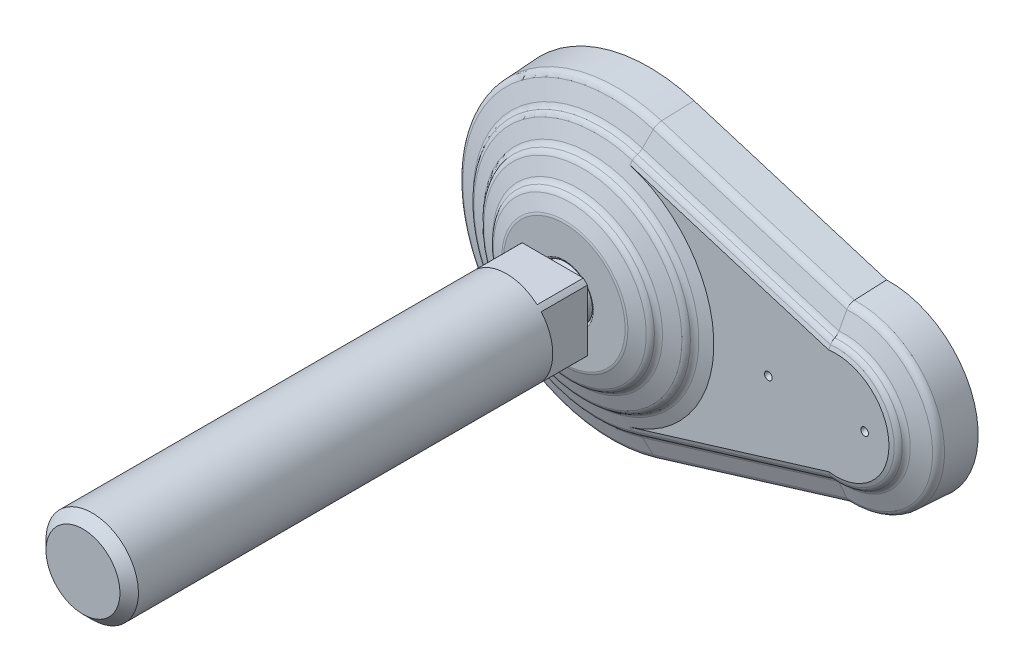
ISO-10303-21;
HEADER;
FILE_DESCRIPTION(('STEP AP214'),'2;1');
FILE_NAME('part.step','',(''),(''),'','','');
FILE_SCHEMA(('AUTOMOTIVE_DESIGN { 1 0 10303 214 1 1 1 1 }'));
ENDSEC;
DATA;
#1=APPLICATION_CONTEXT('core data for automotive mechanical design processes');
#2=APPLICATION_PROTOCOL_DEFINITION('international standard','automotive_design',2000,#1);
#3=PRODUCT_CONTEXT('',#1,'mechanical');
#4=PRODUCT('Part','Part','',(#3));
#5=PRODUCT_RELATED_PRODUCT_CATEGORY('part','',(#4));
#6=PRODUCT_DEFINITION_FORMATION('','',#4);
#7=PRODUCT_DEFINITION_CONTEXT('part definition',#1,'design');
#8=PRODUCT_DEFINITION('design','',#6,#7);
#9=PRODUCT_DEFINITION_SHAPE('','',#8);
#10=(LENGTH_UNIT() NAMED_UNIT(*) SI_UNIT(.MILLI.,.METRE.));
#11=(NAMED_UNIT(*) PLANE_ANGLE_UNIT() SI_UNIT($,.RADIAN.));
#12=(NAMED_UNIT(*) SI_UNIT($,.STERADIAN.) SOLID_ANGLE_UNIT());
#13=UNCERTAINTY_MEASURE_WITH_UNIT(LENGTH_MEASURE(1.E-05),#10,'distance_accuracy_value','');
#14=(GEOMETRIC_REPRESENTATION_CONTEXT(3) GLOBAL_UNCERTAINTY_ASSIGNED_CONTEXT((#13)) GLOBAL_UNIT_ASSIGNED_CONTEXT((#10,
#11,#12)) REPRESENTATION_CONTEXT('',''));
#15=CARTESIAN_POINT('',(0.,0.,0.));
#16=DIRECTION('',(0.,0.,1.));
#17=DIRECTION('',(1.,0.,0.));
#18=AXIS2_PLACEMENT_3D('',#15,#16,#17);
#19=CARTESIAN_POINT('',(0.,0.,39.));
#20=DIRECTION('',(0.,0.,1.));
#21=DIRECTION('',(-1.,0.,0.));
#22=AXIS2_PLACEMENT_3D('',#19,#20,#21);
#23=CYLINDRICAL_SURFACE('',#22,12.);
#24=CARTESIAN_POINT('',(0.,0.,146.6));
#25=DIRECTION('',(0.,0.,1.));
#26=DIRECTION('',(-1.,0.,0.));
#27=AXIS2_PLACEMENT_3D('',#24,#25,#26);
#28=CIRCLE('',#27,12.);
#29=CARTESIAN_POINT('',(-12.,0.,146.6));
#30=VERTEX_POINT('',#29);
#31=EDGE_CURVE('E9',#30,#30,#28,.F.);
#32=ORIENTED_EDGE('',*,*,#31,.T.);
#33=EDGE_LOOP('',(#32));
#34=FACE_BOUND('',#33,.T.);
#35=DIRECTION('',(0.,0.,1.));
#36=VECTOR('',#35,1.);
#37=CARTESIAN_POINT('',(-7.93725393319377,-9.,39.));
#38=LINE('',#37,#36);
#39=CARTESIAN_POINT('',(-7.93725393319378,-9.,39.));
#40=VERTEX_POINT('',#39);
#41=CARTESIAN_POINT('',(-7.93725393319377,-9.,27.));
#42=VERTEX_POINT('',#41);
#43=EDGE_CURVE('E159',#40,#42,#38,.F.);
#44=ORIENTED_EDGE('',*,*,#43,.F.);
#45=CARTESIAN_POINT('',(0.,0.,39.));
#46=DIRECTION('',(0.,0.,1.));
#47=DIRECTION('',(0.,-1.,0.));
#48=AXIS2_PLACEMENT_3D('',#45,#46,#47);
#49=CIRCLE('',#48,12.);
#50=CARTESIAN_POINT('',(7.93725393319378,-9.,39.));
#51=VERTEX_POINT('',#50);
#52=EDGE_CURVE('E805',#40,#51,#49,.T.);
#53=ORIENTED_EDGE('',*,*,#52,.T.);
#54=DIRECTION('',(0.,0.,1.));
#55=VECTOR('',#54,1.);
#56=CARTESIAN_POINT('',(7.93725393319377,-9.,39.));
#57=LINE('',#56,#55);
#58=CARTESIAN_POINT('',(7.93725393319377,-9.,27.));
#59=VERTEX_POINT('',#58);
#60=EDGE_CURVE('E224',#59,#51,#57,.T.);
#61=ORIENTED_EDGE('',*,*,#60,.F.);
#62=CARTESIAN_POINT('',(0.,0.,27.));
#63=DIRECTION('',(0.,0.,1.));
#64=DIRECTION('',(-1.,0.,0.));
#65=AXIS2_PLACEMENT_3D('',#62,#63,#64);
#66=CIRCLE('',#65,12.);
#67=CARTESIAN_POINT('',(9.,-7.93725393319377,27.));
#68=VERTEX_POINT('',#67);
#69=EDGE_CURVE('E207',#59,#68,#66,.T.);
#70=ORIENTED_EDGE('',*,*,#69,.T.);
#71=DIRECTION('',(0.,0.,1.));
#72=VECTOR('',#71,1.);
#73=CARTESIAN_POINT('',(9.,-7.93725393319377,39.));
#74=LINE('',#73,#72);
#75=CARTESIAN_POINT('',(9.,-7.93725393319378,39.));
#76=VERTEX_POINT('',#75);
#77=EDGE_CURVE('E221',#76,#68,#74,.F.);
#78=ORIENTED_EDGE('',*,*,#77,.F.);
#79=CARTESIAN_POINT('',(9.,7.93725393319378,39.));
#80=VERTEX_POINT('',#79);
#81=EDGE_CURVE('E301',#76,#80,#49,.T.);
#82=ORIENTED_EDGE('',*,*,#81,.T.);
#83=DIRECTION('',(0.,0.,1.));
#84=VECTOR('',#83,1.);
#85=CARTESIAN_POINT('',(9.,7.93725393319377,39.));
#86=LINE('',#85,#84);
#87=CARTESIAN_POINT('',(9.,7.93725393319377,27.));
#88=VERTEX_POINT('',#87);
#89=EDGE_CURVE('E266',#88,#80,#86,.T.);
#90=ORIENTED_EDGE('',*,*,#89,.F.);
#91=CARTESIAN_POINT('',(7.93725393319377,9.,27.));
#92=VERTEX_POINT('',#91);
#93=EDGE_CURVE('E203',#88,#92,#66,.T.);
#94=ORIENTED_EDGE('',*,*,#93,.T.);
#95=DIRECTION('',(0.,0.,1.));
#96=VECTOR('',#95,1.);
#97=CARTESIAN_POINT('',(7.93725393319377,9.,39.));
#98=LINE('',#97,#96);
#99=CARTESIAN_POINT('',(7.93725393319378,9.,39.));
#100=VERTEX_POINT('',#99);
#101=EDGE_CURVE('E184',#100,#92,#98,.F.);
#102=ORIENTED_EDGE('',*,*,#101,.F.);
#103=CARTESIAN_POINT('',(-7.93725393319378,9.,39.));
#104=VERTEX_POINT('',#103);
#105=EDGE_CURVE('E197',#100,#104,#49,.T.);
#106=ORIENTED_EDGE('',*,*,#105,.T.);
#107=DIRECTION('',(0.,0.,1.));
#108=VECTOR('',#107,1.);
#109=CARTESIAN_POINT('',(-7.93725393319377,9.,39.));
#110=LINE('',#109,#108);
#111=CARTESIAN_POINT('',(-7.93725393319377,9.,27.));
#112=VERTEX_POINT('',#111);
#113=EDGE_CURVE('E182',#112,#104,#110,.T.);
#114=ORIENTED_EDGE('',*,*,#113,.F.);
#115=CARTESIAN_POINT('',(-9.,7.93725393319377,27.));
#116=VERTEX_POINT('',#115);
#117=EDGE_CURVE('E195',#112,#116,#66,.T.);
#118=ORIENTED_EDGE('',*,*,#117,.T.);
#119=DIRECTION('',(0.,0.,1.));
#120=VECTOR('',#119,1.);
#121=CARTESIAN_POINT('',(-9.,7.93725393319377,39.));
#122=LINE('',#121,#120);
#123=CARTESIAN_POINT('',(-9.,7.93725393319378,39.));
#124=VERTEX_POINT('',#123);
#125=EDGE_CURVE('E198',#124,#116,#122,.F.);
#126=ORIENTED_EDGE('',*,*,#125,.F.);
#127=CARTESIAN_POINT('',(-9.,-7.93725393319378,39.));
#128=VERTEX_POINT('',#127);
#129=EDGE_CURVE('E806',#124,#128,#49,.T.);
#130=ORIENTED_EDGE('',*,*,#129,.T.);
#131=DIRECTION('',(0.,0.,1.));
#132=VECTOR('',#131,1.);
#133=CARTESIAN_POINT('',(-9.,-7.93725393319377,39.));
#134=LINE('',#133,#132);
#135=CARTESIAN_POINT('',(-9.,-7.93725393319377,27.));
#136=VERTEX_POINT('',#135);
#137=EDGE_CURVE('E204',#136,#128,#134,.T.);
#138=ORIENTED_EDGE('',*,*,#137,.F.);
#139=EDGE_CURVE('E206',#136,#42,#66,.T.);
#140=ORIENTED_EDGE('',*,*,#139,.T.);
#141=EDGE_LOOP('',(#44,#53,#61,#70,#78,#82,#90,#94,#102,#106,#114,#118,#126,#130,#138,#140));
#142=FACE_BOUND('',#141,.T.);
#143=ADVANCED_FACE('F15',(#34,#142),#23,.T.);
#144=CARTESIAN_POINT('',(-5.26544933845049,0.,27.));
#145=DIRECTION('',(0.,0.,1.));
#146=DIRECTION('',(-1.,0.,0.));
#147=AXIS2_PLACEMENT_3D('',#144,#145,#146);
#148=PLANE('',#147);
#149=DIRECTION('',(0.,-1.,0.));
#150=VECTOR('',#149,1.);
#151=CARTESIAN_POINT('',(-9.,9.,27.));
#152=LINE('',#151,#150);
#153=EDGE_CURVE('E32',#116,#136,#152,.T.);
#154=ORIENTED_EDGE('',*,*,#153,.F.);
#155=ORIENTED_EDGE('',*,*,#117,.F.);
#156=DIRECTION('',(-1.,0.,0.));
#157=VECTOR('',#156,1.);
#158=CARTESIAN_POINT('',(9.,9.,27.));
#159=LINE('',#158,#157);
#160=EDGE_CURVE('E177',#92,#112,#159,.T.);
#161=ORIENTED_EDGE('',*,*,#160,.F.);
#162=ORIENTED_EDGE('',*,*,#93,.F.);
#163=DIRECTION('',(0.,1.,0.));
#164=VECTOR('',#163,1.);
#165=CARTESIAN_POINT('',(9.,-9.,27.));
#166=LINE('',#165,#164);
#167=EDGE_CURVE('E189',#68,#88,#166,.T.);
#168=ORIENTED_EDGE('',*,*,#167,.F.);
#169=ORIENTED_EDGE('',*,*,#69,.F.);
#170=DIRECTION('',(1.,0.,0.));
#171=VECTOR('',#170,1.);
#172=CARTESIAN_POINT('',(-9.,-9.,27.));
#173=LINE('',#172,#171);
#174=EDGE_CURVE('E226',#42,#59,#173,.T.);
#175=ORIENTED_EDGE('',*,*,#174,.F.);
#176=ORIENTED_EDGE('',*,*,#139,.F.);
#177=EDGE_LOOP('',(#154,#155,#161,#162,#168,#169,#175,#176));
#178=FACE_BOUND('',#177,.T.);
#179=CARTESIAN_POINT('',(0.,0.,27.));
#180=DIRECTION('',(0.,0.,1.));
#181=DIRECTION('',(-1.,0.,0.));
#182=AXIS2_PLACEMENT_3D('',#179,#180,#181);
#183=CIRCLE('',#182,5.26544933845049);
#184=CARTESIAN_POINT('',(-5.26544933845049,0.,27.));
#185=VERTEX_POINT('',#184);
#186=EDGE_CURVE('E212',#185,#185,#183,.T.);
#187=ORIENTED_EDGE('',*,*,#186,.T.);
#188=EDGE_LOOP('',(#187));
#189=FACE_BOUND('',#188,.T.);
#190=ADVANCED_FACE('F200',(#178,#189),#148,.F.);
#191=CARTESIAN_POINT('',(0.,0.,20.6509999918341));
#192=DIRECTION('',(0.,0.,1.));
#193=DIRECTION('',(-1.,0.,0.));
#194=AXIS2_PLACEMENT_3D('',#191,#192,#193);
#195=DEGENERATE_TOROIDAL_SURFACE('',#194,0.000333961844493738,6.829,.T.);
#196=CARTESIAN_POINT('',(0.,0.,21.794));
#197=DIRECTION('',(0.,0.,-1.));
#198=DIRECTION('',(1.,0.,0.));
#199=AXIS2_PLACEMENT_3D('',#196,#197,#198);
#200=CIRCLE('',#199,6.733);
#201=CARTESIAN_POINT('',(6.733,0.,21.794));
#202=VERTEX_POINT('',#201);
#203=EDGE_CURVE('E273',#202,#202,#200,.T.);
#204=ORIENTED_EDGE('',*,*,#203,.F.);
#205=EDGE_LOOP('',(#204));
#206=FACE_BOUND('',#205,.T.);
#207=CARTESIAN_POINT('',(0.,0.,25.));
#208=DIRECTION('',(0.,0.,1.));
#209=DIRECTION('',(-1.,0.,0.));
#210=AXIS2_PLACEMENT_3D('',#207,#208,#209);
#211=CIRCLE('',#210,5.2654493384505);
#212=CARTESIAN_POINT('',(-5.2654493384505,0.,25.));
#213=VERTEX_POINT('',#212);
#214=EDGE_CURVE('E214',#213,#213,#211,.T.);
#215=ORIENTED_EDGE('',*,*,#214,.F.);
#216=EDGE_LOOP('',(#215));
#217=FACE_BOUND('',#216,.T.);
#218=ADVANCED_FACE('F512',(#206,#217),#195,.T.);
#219=CARTESIAN_POINT('',(0.,0.,39.));
#220=DIRECTION('',(0.,0.,1.));
#221=DIRECTION('',(-1.,0.,0.));
#222=AXIS2_PLACEMENT_3D('',#219,#220,#221);
#223=CYLINDRICAL_SURFACE('',#222,5.2654493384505);
#224=ORIENTED_EDGE('',*,*,#186,.F.);
#225=EDGE_LOOP('',(#224));
#226=FACE_BOUND('',#225,.T.);
#227=ORIENTED_EDGE('',*,*,#214,.T.);
#228=EDGE_LOOP('',(#227));
#229=FACE_BOUND('',#228,.T.);
#230=ADVANCED_FACE('F780',(#226,#229),#223,.T.);
#231=CARTESIAN_POINT('',(-9.,-9.,27.));
#232=DIRECTION('',(0.,-1.,0.));
#233=DIRECTION('',(1.,0.,0.));
#234=AXIS2_PLACEMENT_3D('',#231,#232,#233);
#235=PLANE('',#234);
#236=ORIENTED_EDGE('',*,*,#60,.T.);
#237=DIRECTION('',(-1.,0.,0.));
#238=VECTOR('',#237,1.);
#239=CARTESIAN_POINT('',(-12.,-9.,39.));
#240=LINE('',#239,#238);
#241=EDGE_CURVE('E238',#51,#40,#240,.T.);
#242=ORIENTED_EDGE('',*,*,#241,.T.);
#243=ORIENTED_EDGE('',*,*,#43,.T.);
#244=ORIENTED_EDGE('',*,*,#174,.T.);
#245=EDGE_LOOP('',(#236,#242,#243,#244));
#246=FACE_BOUND('',#245,.T.);
#247=ADVANCED_FACE('F778',(#246),#235,.T.);
#248=CARTESIAN_POINT('',(9.,-9.,27.));
#249=DIRECTION('',(1.,0.,0.));
#250=DIRECTION('',(0.,1.,0.));
#251=AXIS2_PLACEMENT_3D('',#248,#249,#250);
#252=PLANE('',#251);
#253=ORIENTED_EDGE('',*,*,#89,.T.);
#254=DIRECTION('',(0.,-1.,0.));
#255=VECTOR('',#254,1.);
#256=CARTESIAN_POINT('',(9.,0.,39.));
#257=LINE('',#256,#255);
#258=EDGE_CURVE('E245',#80,#76,#257,.T.);
#259=ORIENTED_EDGE('',*,*,#258,.T.);
#260=ORIENTED_EDGE('',*,*,#77,.T.);
#261=ORIENTED_EDGE('',*,*,#167,.T.);
#262=EDGE_LOOP('',(#253,#259,#260,#261));
#263=FACE_BOUND('',#262,.T.);
#264=ADVANCED_FACE('F774',(#263),#252,.T.);
#265=CARTESIAN_POINT('',(9.,9.,27.));
#266=DIRECTION('',(0.,1.,0.));
#267=DIRECTION('',(-1.,0.,0.));
#268=AXIS2_PLACEMENT_3D('',#265,#266,#267);
#269=PLANE('',#268);
#270=ORIENTED_EDGE('',*,*,#113,.T.);
#271=DIRECTION('',(1.,0.,0.));
#272=VECTOR('',#271,1.);
#273=CARTESIAN_POINT('',(-12.,9.,39.));
#274=LINE('',#273,#272);
#275=EDGE_CURVE('E249',#104,#100,#274,.T.);
#276=ORIENTED_EDGE('',*,*,#275,.T.);
#277=ORIENTED_EDGE('',*,*,#101,.T.);
#278=ORIENTED_EDGE('',*,*,#160,.T.);
#279=EDGE_LOOP('',(#270,#276,#277,#278));
#280=FACE_BOUND('',#279,.T.);
#281=ADVANCED_FACE('F179',(#280),#269,.T.);
#282=CARTESIAN_POINT('',(-9.,9.,27.));
#283=DIRECTION('',(-1.,0.,0.));
#284=DIRECTION('',(0.,-1.,0.));
#285=AXIS2_PLACEMENT_3D('',#282,#283,#284);
#286=PLANE('',#285);
#287=ORIENTED_EDGE('',*,*,#137,.T.);
#288=DIRECTION('',(0.,1.,0.));
#289=VECTOR('',#288,1.);
#290=CARTESIAN_POINT('',(-9.,0.,39.));
#291=LINE('',#290,#289);
#292=EDGE_CURVE('E262',#128,#124,#291,.T.);
#293=ORIENTED_EDGE('',*,*,#292,.T.);
#294=ORIENTED_EDGE('',*,*,#125,.T.);
#295=ORIENTED_EDGE('',*,*,#153,.T.);
#296=EDGE_LOOP('',(#287,#293,#294,#295));
#297=FACE_BOUND('',#296,.T.);
#298=ADVANCED_FACE('F754',(#297),#286,.T.);
#299=CARTESIAN_POINT('',(0.,0.,0.));
#300=DIRECTION('',(0.,0.,1.));
#301=DIRECTION('',(0.,-1.,0.));
#302=AXIS2_PLACEMENT_3D('',#299,#300,#301);
#303=PLANE('',#302);
#304=DIRECTION('',(-0.951485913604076,0.307692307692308,0.));
#305=VECTOR('',#304,1.);
#306=CARTESIAN_POINT('',(69.9230769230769,15.2237746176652,0.));
#307=LINE('',#306,#305);
#308=CARTESIAN_POINT('',(69.9230769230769,15.2237746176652,0.));
#309=VERTEX_POINT('',#308);
#310=CARTESIAN_POINT('',(11.0769230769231,34.2534928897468,0.));
#311=VERTEX_POINT('',#310);
#312=EDGE_CURVE('E285',#309,#311,#307,.T.);
#313=ORIENTED_EDGE('',*,*,#312,.F.);
#314=CARTESIAN_POINT('',(65.,0.,0.));
#315=DIRECTION('',(0.,0.,1.));
#316=DIRECTION('',(1.,0.,0.));
#317=AXIS2_PLACEMENT_3D('',#314,#315,#316);
#318=CIRCLE('',#317,16.);
#319=CARTESIAN_POINT('',(69.9230769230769,-15.2237746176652,0.));
#320=VERTEX_POINT('',#319);
#321=EDGE_CURVE('E295',#320,#309,#318,.T.);
#322=ORIENTED_EDGE('',*,*,#321,.F.);
#323=DIRECTION('',(0.951485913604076,0.307692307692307,0.));
#324=VECTOR('',#323,1.);
#325=CARTESIAN_POINT('',(11.0769230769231,-34.2534928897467,0.));
#326=LINE('',#325,#324);
#327=CARTESIAN_POINT('',(11.0769230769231,-34.2534928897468,0.));
#328=VERTEX_POINT('',#327);
#329=EDGE_CURVE('E292',#328,#320,#326,.T.);
#330=ORIENTED_EDGE('',*,*,#329,.F.);
#331=CARTESIAN_POINT('',(0.,0.,0.));
#332=DIRECTION('',(0.,0.,1.));
#333=DIRECTION('',(1.,0.,0.));
#334=AXIS2_PLACEMENT_3D('',#331,#332,#333);
#335=CIRCLE('',#334,36.);
#336=EDGE_CURVE('E288',#311,#328,#335,.T.);
#337=ORIENTED_EDGE('',*,*,#336,.F.);
#338=EDGE_LOOP('',(#313,#322,#330,#337));
#339=FACE_BOUND('',#338,.T.);
#340=ADVANCED_FACE('F514',(#339),#303,.F.);
#341=CARTESIAN_POINT('',(11.0769230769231,-34.2534928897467,0.));
#342=DIRECTION('',(0.307692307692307,-0.951485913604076,0.));
#343=DIRECTION('',(0.951485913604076,0.307692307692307,0.));
#344=AXIS2_PLACEMENT_3D('',#341,#342,#343);
#345=PLANE('',#344);
#346=DIRECTION('',(0.951485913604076,0.307692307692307,0.));
#347=VECTOR('',#346,1.);
#348=CARTESIAN_POINT('',(11.0769230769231,-34.2534928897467,2.));
#349=LINE('',#348,#347);
#350=CARTESIAN_POINT('',(11.0769230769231,-34.2534928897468,2.));
#351=VERTEX_POINT('',#350);
#352=CARTESIAN_POINT('',(69.9230769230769,-15.2237746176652,2.));
#353=VERTEX_POINT('',#352);
#354=EDGE_CURVE('E304',#351,#353,#349,.T.);
#355=ORIENTED_EDGE('',*,*,#354,.F.);
#356=DIRECTION('',(0.,0.,1.));
#357=VECTOR('',#356,1.);
#358=CARTESIAN_POINT('',(11.0769230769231,-34.2534928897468,0.));
#359=LINE('',#358,#357);
#360=EDGE_CURVE('E312',#328,#351,#359,.T.);
#361=ORIENTED_EDGE('',*,*,#360,.F.);
#362=ORIENTED_EDGE('',*,*,#329,.T.);
#363=DIRECTION('',(0.,0.,1.));
#364=VECTOR('',#363,1.);
#365=CARTESIAN_POINT('',(69.9230769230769,-15.2237746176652,0.));
#366=LINE('',#365,#364);
#367=EDGE_CURVE('E310',#320,#353,#366,.T.);
#368=ORIENTED_EDGE('',*,*,#367,.T.);
#369=EDGE_LOOP('',(#355,#361,#362,#368));
#370=FACE_BOUND('',#369,.T.);
#371=ADVANCED_FACE('F771',(#370),#345,.T.);
#372=CARTESIAN_POINT('',(0.,0.,0.));
#373=DIRECTION('',(0.,0.,1.));
#374=DIRECTION('',(0.,-1.,0.));
#375=AXIS2_PLACEMENT_3D('',#372,#373,#374);
#376=CYLINDRICAL_SURFACE('',#375,36.);
#377=CARTESIAN_POINT('',(0.,0.,2.));
#378=DIRECTION('',(0.,0.,1.));
#379=DIRECTION('',(1.,0.,0.));
#380=AXIS2_PLACEMENT_3D('',#377,#378,#379);
#381=CIRCLE('',#380,36.);
#382=CARTESIAN_POINT('',(11.0769230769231,34.2534928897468,2.));
#383=VERTEX_POINT('',#382);
#384=EDGE_CURVE('E300',#383,#351,#381,.T.);
#385=ORIENTED_EDGE('',*,*,#384,.F.);
#386=DIRECTION('',(0.,0.,1.));
#387=VECTOR('',#386,1.);
#388=CARTESIAN_POINT('',(11.0769230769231,34.2534928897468,0.));
#389=LINE('',#388,#387);
#390=EDGE_CURVE('E314',#311,#383,#389,.T.);
#391=ORIENTED_EDGE('',*,*,#390,.F.);
#392=ORIENTED_EDGE('',*,*,#336,.T.);
#393=ORIENTED_EDGE('',*,*,#360,.T.);
#394=EDGE_LOOP('',(#385,#391,#392,#393));
#395=FACE_BOUND('',#394,.T.);
#396=ADVANCED_FACE('F1138',(#395),#376,.T.);
#397=CARTESIAN_POINT('',(69.9230769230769,15.2237746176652,0.));
#398=DIRECTION('',(0.307692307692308,0.951485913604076,0.));
#399=DIRECTION('',(-0.951485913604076,0.307692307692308,0.));
#400=AXIS2_PLACEMENT_3D('',#397,#398,#399);
#401=PLANE('',#400);
#402=DIRECTION('',(-0.951485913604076,0.307692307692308,0.));
#403=VECTOR('',#402,1.);
#404=CARTESIAN_POINT('',(69.9230769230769,15.2237746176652,2.));
#405=LINE('',#404,#403);
#406=CARTESIAN_POINT('',(69.9230769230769,15.2237746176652,2.));
#407=VERTEX_POINT('',#406);
#408=EDGE_CURVE('E150',#407,#383,#405,.T.);
#409=ORIENTED_EDGE('',*,*,#408,.F.);
#410=DIRECTION('',(0.,0.,1.));
#411=VECTOR('',#410,1.);
#412=CARTESIAN_POINT('',(69.9230769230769,15.2237746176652,0.));
#413=LINE('',#412,#411);
#414=EDGE_CURVE('E298',#309,#407,#413,.T.);
#415=ORIENTED_EDGE('',*,*,#414,.F.);
#416=ORIENTED_EDGE('',*,*,#312,.T.);
#417=ORIENTED_EDGE('',*,*,#390,.T.);
#418=EDGE_LOOP('',(#409,#415,#416,#417));
#419=FACE_BOUND('',#418,.T.);
#420=ADVANCED_FACE('F538',(#419),#401,.T.);
#421=CARTESIAN_POINT('',(65.,0.,0.));
#422=DIRECTION('',(0.,0.,1.));
#423=DIRECTION('',(0.,-1.,0.));
#424=AXIS2_PLACEMENT_3D('',#421,#422,#423);
#425=CYLINDRICAL_SURFACE('',#424,16.);
#426=CARTESIAN_POINT('',(65.,0.,2.));
#427=DIRECTION('',(0.,0.,1.));
#428=DIRECTION('',(1.,0.,0.));
#429=AXIS2_PLACEMENT_3D('',#426,#427,#428);
#430=CIRCLE('',#429,16.);
#431=EDGE_CURVE('E289',#353,#407,#430,.T.);
#432=ORIENTED_EDGE('',*,*,#431,.F.);
#433=ORIENTED_EDGE('',*,*,#367,.F.);
#434=ORIENTED_EDGE('',*,*,#321,.T.);
#435=ORIENTED_EDGE('',*,*,#414,.T.);
#436=EDGE_LOOP('',(#432,#433,#434,#435));
#437=FACE_BOUND('',#436,.T.);
#438=ADVANCED_FACE('F523',(#437),#425,.T.);
#439=CARTESIAN_POINT('',(62.5,0.,2.));
#440=DIRECTION('',(0.,0.,-1.));
#441=DIRECTION('',(0.,1.,0.));
#442=AXIS2_PLACEMENT_3D('',#439,#440,#441);
#443=CONICAL_SURFACE('',#442,22.9787234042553,0.0523365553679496);
#444=CARTESIAN_POINT('',(62.5,0.,10.3041173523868));
#445=DIRECTION('',(0.,0.,1.));
#446=DIRECTION('',(0.,-1.,0.));
#447=AXIS2_PLACEMENT_3D('',#444,#445,#446);
#448=CIRCLE('',#447,22.5437172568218);
#449=CARTESIAN_POINT('',(61.6407011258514,-22.5273343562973,10.3041173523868));
#450=VERTEX_POINT('',#449);
#451=CARTESIAN_POINT('',(61.6407011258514,22.5273343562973,10.3041173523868));
#452=VERTEX_POINT('',#451);
#453=EDGE_CURVE('E344',#450,#452,#448,.T.);
#454=ORIENTED_EDGE('',*,*,#453,.F.);
#455=CARTESIAN_POINT('',(61.6406997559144,-22.5273238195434,10.3043173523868));
#456=CARTESIAN_POINT('',(61.6501805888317,-22.600242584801,8.92023165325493));
#457=CARTESIAN_POINT('',(61.6596900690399,-22.6731526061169,7.53614569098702));
#458=CARTESIAN_POINT('',(61.6787663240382,-22.8189551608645,4.76797324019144));
#459=CARTESIAN_POINT('',(61.6883330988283,-22.8918476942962,3.38388675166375));
#460=CARTESIAN_POINT('',(61.6979285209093,-22.9647314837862,1.9998));
#461=B_SPLINE_CURVE_WITH_KNOTS('',3,(#455,#456,#457,#458,#459,#460),.UNSPECIFIED.,.F.,.F.,(4,2,
4),(0.,4.15811282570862,8.31622565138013),.UNSPECIFIED.);
#462=CARTESIAN_POINT('',(61.697927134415,-22.9647209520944,2.));
#463=VERTEX_POINT('',#462);
#464=EDGE_CURVE('E651',#450,#463,#461,.T.);
#465=ORIENTED_EDGE('',*,*,#464,.T.);
#466=CARTESIAN_POINT('',(62.5,0.,2.));
#467=DIRECTION('',(0.,0.,1.));
#468=DIRECTION('',(0.,-1.,0.));
#469=AXIS2_PLACEMENT_3D('',#466,#467,#468);
#470=CIRCLE('',#469,22.9787234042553);
#471=CARTESIAN_POINT('',(61.6979271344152,22.9647209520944,2.));
#472=VERTEX_POINT('',#471);
#473=EDGE_CURVE('E346',#463,#472,#470,.T.);
#474=ORIENTED_EDGE('',*,*,#473,.T.);
#475=CARTESIAN_POINT('',(61.6979285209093,22.9647314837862,1.9998));
#476=CARTESIAN_POINT('',(61.6883330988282,22.8918476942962,3.38388675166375));
#477=CARTESIAN_POINT('',(61.6787663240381,22.8189551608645,4.76797324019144));
#478=CARTESIAN_POINT('',(61.6596900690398,22.6731526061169,7.53614569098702));
#479=CARTESIAN_POINT('',(61.6501805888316,22.600242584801,8.92023165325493));
#480=CARTESIAN_POINT('',(61.6406997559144,22.5273238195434,10.3043173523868));
#481=B_SPLINE_CURVE_WITH_KNOTS('',3,(#475,#476,#477,#478,#479,#480),.UNSPECIFIED.,.F.,.F.,(4,2,
4),(0.,4.15811282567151,8.31622565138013),.UNSPECIFIED.);
#482=EDGE_CURVE('E697',#472,#452,#481,.T.);
#483=ORIENTED_EDGE('',*,*,#482,.T.);
#484=EDGE_LOOP('',(#454,#465,#474,#483));
#485=FACE_BOUND('',#484,.T.);
#486=ADVANCED_FACE('F517',(#485),#443,.T.);
#487=CARTESIAN_POINT('',(64.1644462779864,-21.755748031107,10.3041173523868));
#488=DIRECTION('',(-0.291971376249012,0.9549953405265,-0.0523126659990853));
#489=DIRECTION('',(-0.956304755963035,-0.292371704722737,0.));
#490=AXIS2_PLACEMENT_3D('',#487,#488,#489);
#491=PLANE('',#490);
#492=ORIENTED_EDGE('',*,*,#464,.F.);
#493=DIRECTION('',(-0.956304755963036,-0.292371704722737,0.));
#494=VECTOR('',#493,1.);
#495=CARTESIAN_POINT('',(64.1644462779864,-21.755748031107,10.3041173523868));
#496=LINE('',#495,#494);
#497=CARTESIAN_POINT('',(11.5676847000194,-37.8361917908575,10.3041173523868));
#498=VERTEX_POINT('',#497);
#499=EDGE_CURVE('E600',#450,#498,#496,.T.);
#500=ORIENTED_EDGE('',*,*,#499,.T.);
#501=DIRECTION('',(-0.0152947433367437,0.050026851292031,0.998630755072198));
#502=VECTOR('',#501,1.);
#503=CARTESIAN_POINT('',(11.6948681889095,-38.2521902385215,2.));
#504=LINE('',#503,#502);
#505=CARTESIAN_POINT('',(11.6948681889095,-38.2521902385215,2.));
#506=VERTEX_POINT('',#505);
#507=EDGE_CURVE('E606',#506,#498,#504,.T.);
#508=ORIENTED_EDGE('',*,*,#507,.F.);
#509=DIRECTION('',(-0.956304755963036,-0.292371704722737,0.));
#510=VECTOR('',#509,1.);
#511=CARTESIAN_POINT('',(64.2916297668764,-22.1717464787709,2.));
#512=LINE('',#511,#510);
#513=EDGE_CURVE('E144',#463,#506,#512,.T.);
#514=ORIENTED_EDGE('',*,*,#513,.F.);
#515=EDGE_LOOP('',(#492,#500,#508,#514));
#516=FACE_BOUND('',#515,.T.);
#517=ADVANCED_FACE('F508',(#516),#491,.F.);
#518=CARTESIAN_POINT('',(0.,0.,2.));
#519=DIRECTION('',(0.,0.,1.));
#520=DIRECTION('',(-1.,0.,0.));
#521=AXIS2_PLACEMENT_3D('',#518,#519,#520);
#522=PLANE('',#521);
#523=DIRECTION('',(-0.956304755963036,0.292371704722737,0.));
#524=VECTOR('',#523,1.);
#525=CARTESIAN_POINT('',(64.2916297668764,22.1717464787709,2.));
#526=LINE('',#525,#524);
#527=CARTESIAN_POINT('',(11.6948681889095,38.2521902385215,2.));
#528=VERTEX_POINT('',#527);
#529=EDGE_CURVE('E653',#472,#528,#526,.T.);
#530=ORIENTED_EDGE('',*,*,#529,.F.);
#531=ORIENTED_EDGE('',*,*,#473,.F.);
#532=ORIENTED_EDGE('',*,*,#513,.T.);
#533=CARTESIAN_POINT('',(0.,0.,2.));
#534=DIRECTION('',(0.,0.,1.));
#535=DIRECTION('',(-1.,0.,0.));
#536=AXIS2_PLACEMENT_3D('',#533,#534,#535);
#537=CIRCLE('',#536,40.);
#538=EDGE_CURVE('E389',#528,#506,#537,.T.);
#539=ORIENTED_EDGE('',*,*,#538,.F.);
#540=EDGE_LOOP('',(#530,#531,#532,#539));
#541=FACE_BOUND('',#540,.T.);
#542=ORIENTED_EDGE('',*,*,#431,.T.);
#543=ORIENTED_EDGE('',*,*,#408,.T.);
#544=ORIENTED_EDGE('',*,*,#384,.T.);
#545=ORIENTED_EDGE('',*,*,#354,.T.);
#546=EDGE_LOOP('',(#542,#543,#544,#545));
#547=FACE_BOUND('',#546,.T.);
#548=ADVANCED_FACE('F398',(#541,#547),#522,.F.);
#549=CARTESIAN_POINT('',(64.2916297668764,22.1717464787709,2.));
#550=DIRECTION('',(-0.291971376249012,-0.9549953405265,-0.0523126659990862));
#551=DIRECTION('',(0.956304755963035,-0.292371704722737,0.));
#552=AXIS2_PLACEMENT_3D('',#549,#550,#551);
#553=PLANE('',#552);
#554=ORIENTED_EDGE('',*,*,#482,.F.);
#555=ORIENTED_EDGE('',*,*,#529,.T.);
#556=DIRECTION('',(-0.0152947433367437,-0.050026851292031,0.998630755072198));
#557=VECTOR('',#556,1.);
#558=CARTESIAN_POINT('',(11.6948681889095,38.2521902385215,2.));
#559=LINE('',#558,#557);
#560=CARTESIAN_POINT('',(11.5676847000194,37.8361917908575,10.3041173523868));
#561=VERTEX_POINT('',#560);
#562=EDGE_CURVE('E620',#528,#561,#559,.T.);
#563=ORIENTED_EDGE('',*,*,#562,.T.);
#564=DIRECTION('',(-0.956304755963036,0.292371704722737,0.));
#565=VECTOR('',#564,1.);
#566=CARTESIAN_POINT('',(64.1644462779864,21.755748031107,10.3041173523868));
#567=LINE('',#566,#565);
#568=EDGE_CURVE('E654',#452,#561,#567,.T.);
#569=ORIENTED_EDGE('',*,*,#568,.F.);
#570=EDGE_LOOP('',(#554,#555,#563,#569));
#571=FACE_BOUND('',#570,.T.);
#572=ADVANCED_FACE('F478',(#571),#553,.F.);
#573=CARTESIAN_POINT('',(62.5,0.,10.1991258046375));
#574=DIRECTION('',(0.,0.,1.));
#575=DIRECTION('',(0.,-1.,0.));
#576=AXIS2_PLACEMENT_3D('',#573,#574,#575);
#577=TOROIDAL_SURFACE('',#576,20.5394653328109,2.007);
#578=CARTESIAN_POINT('',(61.6407233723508,-22.5275054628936,10.0974340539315));
#579=CARTESIAN_POINT('',(61.6409510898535,-22.5292569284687,10.1317993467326));
#580=CARTESIAN_POINT('',(61.6410635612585,-22.5301219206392,10.1661964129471));
#581=CARTESIAN_POINT('',(61.6410572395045,-22.5300732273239,10.235045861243));
#582=CARTESIAN_POINT('',(61.6409380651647,-22.5291566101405,10.2694982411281));
#583=CARTESIAN_POINT('',(61.6399396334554,-22.5214778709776,10.4153785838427));
#584=CARTESIAN_POINT('',(61.6379561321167,-22.5062239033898,10.526490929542));
#585=CARTESIAN_POINT('',(61.6316126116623,-22.4573679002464,10.7446232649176));
#586=CARTESIAN_POINT('',(61.6272490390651,-22.4237384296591,10.8516368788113));
#587=CARTESIAN_POINT('',(61.6163034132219,-22.339189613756,11.058357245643));
#588=CARTESIAN_POINT('',(61.6097238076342,-22.2882893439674,11.1580719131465));
#589=CARTESIAN_POINT('',(61.5945702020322,-22.1707054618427,11.3475467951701));
#590=CARTESIAN_POINT('',(61.5859960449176,-22.1040206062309,11.4373062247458));
#591=CARTESIAN_POINT('',(61.5670698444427,-21.9562760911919,11.6050783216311));
#592=CARTESIAN_POINT('',(61.5567047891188,-21.8751110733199,11.6829965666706));
#593=CARTESIAN_POINT('',(61.5345911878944,-21.7011851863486,11.8241014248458));
#594=CARTESIAN_POINT('',(61.5228449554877,-21.6084436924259,11.8873121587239));
#595=CARTESIAN_POINT('',(61.5046129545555,-21.4637836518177,11.9692866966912));
#596=CARTESIAN_POINT('',(61.4985079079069,-21.4152343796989,11.9942523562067));
#597=CARTESIAN_POINT('',(61.4860940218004,-21.3162718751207,12.0401972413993));
#598=CARTESIAN_POINT('',(61.4797850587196,-21.2658575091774,12.0611739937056));
#599=CARTESIAN_POINT('',(61.4596293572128,-21.1043762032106,12.1208327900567));
#600=CARTESIAN_POINT('',(61.4454888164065,-20.9904779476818,12.1519983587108));
#601=CARTESIAN_POINT('',(61.4169436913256,-20.7591475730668,12.1941665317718));
#602=CARTESIAN_POINT('',(61.4025394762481,-20.6417202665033,12.2051954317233));
#603=CARTESIAN_POINT('',(61.3876252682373,-20.5193667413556,12.2061070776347));
#604=CARTESIAN_POINT('',(61.3870090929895,-20.5143103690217,12.2061258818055));
#605=CARTESIAN_POINT('',(61.3863931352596,-20.5092543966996,12.2061258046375));
#606=B_SPLINE_CURVE_WITH_KNOTS('',3,(#578,#579,#580,#581,#582,#583,#584,#585,#586,#587,#588,
#589,#590,#591,#592,#593,#594,#595,#596,#597,#598,#599,#600,#601,#602,#603,#604,#605),
.UNSPECIFIED.,.F.,.F.,(4,2,2,2,2,2,2,2,2,2,2,2,2,4),(0.,0.103191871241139,0.20655369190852,
0.541275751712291,0.87649892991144,1.21135305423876,1.54623356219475,1.8836582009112,
2.22052549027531,2.38517216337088,2.54992059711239,2.9048600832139,3.25933573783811,
3.2746170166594),.UNSPECIFIED.);
#607=CARTESIAN_POINT('',(61.4734629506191,-21.2152067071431,12.0798866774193));
#608=VERTEX_POINT('',#607);
#609=EDGE_CURVE('E1245',#450,#608,#606,.T.);
#610=ORIENTED_EDGE('',*,*,#609,.F.);
#611=ORIENTED_EDGE('',*,*,#453,.T.);
#612=CARTESIAN_POINT('',(61.3863931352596,20.5092543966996,12.2061258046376));
#613=CARTESIAN_POINT('',(61.3870091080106,20.5143104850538,12.2061258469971));
#614=CARTESIAN_POINT('',(61.3876252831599,20.5193668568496,12.206107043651));
#615=CARTESIAN_POINT('',(61.3988855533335,20.6117442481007,12.2054193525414));
#616=CARTESIAN_POINT('',(61.4095840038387,20.6991031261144,12.1991511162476));
#617=CARTESIAN_POINT('',(61.4308936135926,20.8723273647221,12.1754412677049));
#618=CARTESIAN_POINT('',(61.4415047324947,20.9581920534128,12.1579947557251));
#619=CARTESIAN_POINT('',(61.4555813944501,21.0716202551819,12.1272225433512));
#620=CARTESIAN_POINT('',(61.4591730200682,21.1005182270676,12.1186877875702));
#621=CARTESIAN_POINT('',(61.4663157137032,21.1579059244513,12.1003430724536));
#622=CARTESIAN_POINT('',(61.4698667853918,21.1863956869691,12.090533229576));
#623=CARTESIAN_POINT('',(61.4866782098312,21.3210820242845,12.0407628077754));
#624=CARTESIAN_POINT('',(61.4996430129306,21.4243838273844,11.9924168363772));
#625=CARTESIAN_POINT('',(61.5245148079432,21.6216549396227,11.8789198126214));
#626=CARTESIAN_POINT('',(61.5364193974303,21.7156031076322,11.8137318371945));
#627=CARTESIAN_POINT('',(61.5587594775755,21.8912250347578,11.6683429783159));
#628=CARTESIAN_POINT('',(61.5691956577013,21.9729045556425,11.5881491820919));
#629=CARTESIAN_POINT('',(61.5882470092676,22.1215501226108,11.4149543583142));
#630=CARTESIAN_POINT('',(61.5968625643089,22.1885192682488,11.3219560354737));
#631=CARTESIAN_POINT('',(61.6119005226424,22.3051440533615,11.1267480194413));
#632=CARTESIAN_POINT('',(61.6183432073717,22.3549598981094,11.0246354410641));
#633=CARTESIAN_POINT('',(61.6289130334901,22.4365717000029,10.8134345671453));
#634=CARTESIAN_POINT('',(61.6330436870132,22.4683949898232,10.704357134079));
#635=CARTESIAN_POINT('',(61.6371976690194,22.5003783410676,10.5457196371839));
#636=CARTESIAN_POINT('',(61.6382205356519,22.5082502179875,10.4976293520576));
#637=CARTESIAN_POINT('',(61.639806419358,22.5204527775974,10.4010313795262));
#638=CARTESIAN_POINT('',(61.6403698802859,22.52478687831,10.3525241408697));
#639=CARTESIAN_POINT('',(61.6411729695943,22.5309631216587,10.2351641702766));
#640=CARTESIAN_POINT('',(61.641181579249,22.5310278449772,10.1662118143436));
#641=CARTESIAN_POINT('',(61.6407233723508,22.5275054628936,10.0974340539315));
#642=B_SPLINE_CURVE_WITH_KNOTS('',3,(#612,#613,#614,#615,#616,#617,#618,#619,#620,#621,#622,
#623,#624,#625,#626,#627,#628,#629,#630,#631,#632,#633,#634,#635,#636,#637,#638,#639,#640,#641),
.UNSPECIFIED.,.F.,.F.,(4,2,2,2,2,2,2,2,2,2,2,2,2,2,4),(0.,0.0152812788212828,0.279174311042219,
0.543183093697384,0.634194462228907,0.725197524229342,1.06775959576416,1.41107914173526,
1.75423694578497,2.09732237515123,2.43711059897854,2.77638125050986,2.92250118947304,
3.06847978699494,3.27496314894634),.UNSPECIFIED.);
#643=CARTESIAN_POINT('',(61.4734629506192,21.2152067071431,12.0798866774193));
#644=VERTEX_POINT('',#643);
#645=EDGE_CURVE('E467',#644,#452,#642,.T.);
#646=ORIENTED_EDGE('',*,*,#645,.F.);
#647=CARTESIAN_POINT('',(62.5,0.,12.0798866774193));
#648=DIRECTION('',(0.,0.,1.));
#649=DIRECTION('',(0.,-1.,0.));
#650=AXIS2_PLACEMENT_3D('',#647,#648,#649);
#651=CIRCLE('',#650,21.2400276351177);
#652=EDGE_CURVE('E342',#608,#644,#651,.T.);
#653=ORIENTED_EDGE('',*,*,#652,.F.);
#654=EDGE_LOOP('',(#610,#611,#646,#653));
#655=FACE_BOUND('',#654,.T.);
#656=ADVANCED_FACE('F449',(#655),#577,.T.);
#657=CARTESIAN_POINT('',(63.5784597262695,-19.8390723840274,10.1991258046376));
#658=DIRECTION('',(-0.956304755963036,-0.292371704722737,0.));
#659=DIRECTION('',(0.292371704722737,-0.956304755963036,0.));
#660=AXIS2_PLACEMENT_3D('',#657,#658,#659);
#661=CYLINDRICAL_SURFACE('',#660,2.00699999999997);
#662=ORIENTED_EDGE('',*,*,#499,.F.);
#663=ORIENTED_EDGE('',*,*,#609,.T.);
#664=DIRECTION('',(-0.956304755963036,-0.292371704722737,0.));
#665=VECTOR('',#664,1.);
#666=CARTESIAN_POINT('',(63.7832843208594,-20.5090234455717,12.0798866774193));
#667=LINE('',#666,#665);
#668=CARTESIAN_POINT('',(11.1865227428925,-36.5894672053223,12.0798866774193));
#669=VERTEX_POINT('',#668);
#670=EDGE_CURVE('E597',#608,#669,#667,.T.);
#671=ORIENTED_EDGE('',*,*,#670,.T.);
#672=CARTESIAN_POINT('',(10.9816981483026,-35.9195161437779,10.1991258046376));
#673=DIRECTION('',(0.956304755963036,0.292371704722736,0.));
#674=DIRECTION('',(-0.292371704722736,0.956304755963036,0.));
#675=AXIS2_PLACEMENT_3D('',#672,#673,#674);
#676=CIRCLE('',#675,2.007);
#677=EDGE_CURVE('E609',#669,#498,#676,.T.);
#678=ORIENTED_EDGE('',*,*,#677,.T.);
#679=EDGE_LOOP('',(#662,#663,#671,#678));
#680=FACE_BOUND('',#679,.T.);
#681=ADVANCED_FACE('F479',(#680),#661,.T.);
#682=CARTESIAN_POINT('',(0.,0.,2.));
#683=DIRECTION('',(0.,0.,-1.));
#684=DIRECTION('',(1.,0.,0.));
#685=AXIS2_PLACEMENT_3D('',#682,#683,#684);
#686=CONICAL_SURFACE('',#685,40.,0.0523365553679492);
#687=CARTESIAN_POINT('',(0.,0.,10.3041173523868));
#688=DIRECTION('',(0.,0.,1.));
#689=DIRECTION('',(-1.,0.,0.));
#690=AXIS2_PLACEMENT_3D('',#687,#688,#689);
#691=CIRCLE('',#690,39.5649938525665);
#692=EDGE_CURVE('E640',#561,#498,#691,.T.);
#693=ORIENTED_EDGE('',*,*,#692,.F.);
#694=ORIENTED_EDGE('',*,*,#562,.F.);
#695=ORIENTED_EDGE('',*,*,#538,.T.);
#696=ORIENTED_EDGE('',*,*,#507,.T.);
#697=EDGE_LOOP('',(#693,#694,#695,#696));
#698=FACE_BOUND('',#697,.T.);
#699=ADVANCED_FACE('F499',(#698),#686,.T.);
#700=CARTESIAN_POINT('',(63.5784597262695,19.8390723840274,10.1991258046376));
#701=DIRECTION('',(-0.956304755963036,0.292371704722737,0.));
#702=DIRECTION('',(-0.292371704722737,-0.956304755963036,0.));
#703=AXIS2_PLACEMENT_3D('',#700,#701,#702);
#704=CYLINDRICAL_SURFACE('',#703,2.00699999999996);
#705=DIRECTION('',(-0.956304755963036,0.292371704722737,0.));
#706=VECTOR('',#705,1.);
#707=CARTESIAN_POINT('',(63.7832843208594,20.5090234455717,12.0798866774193));
#708=LINE('',#707,#706);
#709=CARTESIAN_POINT('',(11.1865227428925,36.5894672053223,12.0798866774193));
#710=VERTEX_POINT('',#709);
#711=EDGE_CURVE('E586',#644,#710,#708,.T.);
#712=ORIENTED_EDGE('',*,*,#711,.F.);
#713=ORIENTED_EDGE('',*,*,#645,.T.);
#714=ORIENTED_EDGE('',*,*,#568,.T.);
#715=CARTESIAN_POINT('',(10.9816981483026,35.9195161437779,10.1991258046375));
#716=DIRECTION('',(-0.956304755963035,0.292371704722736,0.));
#717=DIRECTION('',(-0.292371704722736,-0.956304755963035,0.));
#718=AXIS2_PLACEMENT_3D('',#715,#716,#717);
#719=CIRCLE('',#718,2.007);
#720=EDGE_CURVE('E623',#710,#561,#719,.T.);
#721=ORIENTED_EDGE('',*,*,#720,.F.);
#722=EDGE_LOOP('',(#712,#713,#714,#721));
#723=FACE_BOUND('',#722,.T.);
#724=ADVANCED_FACE('F407',(#723),#704,.T.);
#725=CARTESIAN_POINT('',(62.5,0.,12.0798866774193));
#726=DIRECTION('',(0.,0.,-1.));
#727=DIRECTION('',(0.,1.,0.));
#728=AXIS2_PLACEMENT_3D('',#725,#726,#727);
#729=CONICAL_SURFACE('',#728,21.2400276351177,1.21422909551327);
#730=CARTESIAN_POINT('',(62.5,0.,13.656251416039));
#731=DIRECTION('',(0.,0.,1.));
#732=DIRECTION('',(0.,-1.,0.));
#733=AXIS2_PLACEMENT_3D('',#730,#731,#732);
#734=CIRCLE('',#733,17.0080484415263);
#735=CARTESIAN_POINT('',(60.9818619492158,-16.9401584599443,13.656251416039));
#736=VERTEX_POINT('',#735);
#737=CARTESIAN_POINT('',(60.9818619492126,16.9401584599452,13.656251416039));
#738=VERTEX_POINT('',#737);
#739=EDGE_CURVE('E340',#736,#738,#734,.T.);
#740=ORIENTED_EDGE('',*,*,#739,.F.);
#741=CARTESIAN_POINT('',(60.9818053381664,-16.9396143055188,13.656451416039));
#742=CARTESIAN_POINT('',(61.0189355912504,-17.2964789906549,13.5252879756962));
#743=CARTESIAN_POINT('',(61.0571375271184,-17.653206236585,13.3940567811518));
#744=CARTESIAN_POINT('',(61.1355151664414,-18.3663907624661,13.1314756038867));
#745=CARTESIAN_POINT('',(61.1756908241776,-18.7228480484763,13.0001256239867));
#746=CARTESIAN_POINT('',(61.2578477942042,-19.435511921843,12.7373183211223));
#747=CARTESIAN_POINT('',(61.2998290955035,-19.7917185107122,12.6058609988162));
#748=CARTESIAN_POINT('',(61.3854616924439,-20.5039033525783,12.3428458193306));
#749=CARTESIAN_POINT('',(61.4291130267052,-20.8598816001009,12.2112879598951));
#750=CARTESIAN_POINT('',(61.4735304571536,-21.2157475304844,12.0796866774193));
#751=B_SPLINE_CURVE_WITH_KNOTS('',3,(#741,#742,#743,#744,#745,#746,#747,#748,#749,#750),
.UNSPECIFIED.,.F.,.F.,(4,2,2,2,4),(0.,1.14603990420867,2.29205327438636,3.43805966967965,
4.58409258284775),.UNSPECIFIED.);
#752=EDGE_CURVE('E459',#736,#608,#751,.T.);
#753=ORIENTED_EDGE('',*,*,#752,.T.);
#754=ORIENTED_EDGE('',*,*,#652,.T.);
#755=CARTESIAN_POINT('',(61.4735304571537,21.2157475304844,12.0796866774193));
#756=CARTESIAN_POINT('',(61.4291130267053,20.8598816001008,12.2112879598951));
#757=CARTESIAN_POINT('',(61.3854616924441,20.5039033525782,12.3428458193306));
#758=CARTESIAN_POINT('',(61.2998290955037,19.7917185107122,12.6058609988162));
#759=CARTESIAN_POINT('',(61.2578477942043,19.435511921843,12.7373183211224));
#760=CARTESIAN_POINT('',(61.1756908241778,18.7228480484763,13.0001256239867));
#761=CARTESIAN_POINT('',(61.1355151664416,18.3663907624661,13.1314756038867));
#762=CARTESIAN_POINT('',(61.0571375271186,17.653206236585,13.3940567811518));
#763=CARTESIAN_POINT('',(61.0189355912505,17.2964789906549,13.5252879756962));
#764=CARTESIAN_POINT('',(60.9818053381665,16.9396143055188,13.656451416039));
#765=B_SPLINE_CURVE_WITH_KNOTS('',3,(#755,#756,#757,#758,#759,#760,#761,#762,#763,#764),
.UNSPECIFIED.,.F.,.F.,(4,2,2,2,4),(0.,1.14603291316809,2.29203930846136,3.43805267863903,
4.58409258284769),.UNSPECIFIED.);
#766=EDGE_CURVE('E453',#644,#738,#765,.T.);
#767=ORIENTED_EDGE('',*,*,#766,.T.);
#768=EDGE_LOOP('',(#740,#753,#754,#767));
#769=FACE_BOUND('',#768,.T.);
#770=ADVANCED_FACE('F442',(#769),#729,.T.);
#771=CARTESIAN_POINT('',(62.545973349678,-16.4619616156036,13.656251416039));
#772=DIRECTION('',(-0.102055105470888,0.333807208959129,-0.937100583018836));
#773=DIRECTION('',(0.,0.942019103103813,0.335559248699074));
#774=AXIS2_PLACEMENT_3D('',#771,#772,#773);
#775=PLANE('',#774);
#776=ORIENTED_EDGE('',*,*,#752,.F.);
#777=DIRECTION('',(-0.956304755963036,-0.292371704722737,0.));
#778=VECTOR('',#777,1.);
#779=CARTESIAN_POINT('',(62.545973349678,-16.4619616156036,13.656251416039));
#780=LINE('',#779,#778);
#781=CARTESIAN_POINT('',(9.949211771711,-32.5424053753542,13.656251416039));
#782=VERTEX_POINT('',#781);
#783=EDGE_CURVE('E592',#736,#782,#780,.T.);
#784=ORIENTED_EDGE('',*,*,#783,.T.);
#785=DIRECTION('',(-0.273981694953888,0.896153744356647,0.349059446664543));
#786=VECTOR('',#785,1.);
#787=CARTESIAN_POINT('',(11.1865227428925,-36.5894672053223,12.0798866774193));
#788=LINE('',#787,#786);
#789=EDGE_CURVE('E612',#669,#782,#788,.T.);
#790=ORIENTED_EDGE('',*,*,#789,.F.);
#791=ORIENTED_EDGE('',*,*,#670,.F.);
#792=EDGE_LOOP('',(#776,#784,#790,#791));
#793=FACE_BOUND('',#792,.T.);
#794=ADVANCED_FACE('F447',(#793),#775,.F.);
#795=CARTESIAN_POINT('',(0.,0.,10.1991258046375));
#796=DIRECTION('',(0.,0.,1.));
#797=DIRECTION('',(-1.,0.,0.));
#798=AXIS2_PLACEMENT_3D('',#795,#796,#797);
#799=TOROIDAL_SURFACE('',#798,37.5607419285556,2.007);
#800=CARTESIAN_POINT('',(0.,0.,12.0798866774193));
#801=DIRECTION('',(0.,0.,1.));
#802=DIRECTION('',(-1.,0.,0.));
#803=AXIS2_PLACEMENT_3D('',#800,#801,#802);
#804=CIRCLE('',#803,38.2613042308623);
#805=EDGE_CURVE('E638',#710,#669,#804,.T.);
#806=ORIENTED_EDGE('',*,*,#805,.F.);
#807=ORIENTED_EDGE('',*,*,#720,.T.);
#808=ORIENTED_EDGE('',*,*,#692,.T.);
#809=ORIENTED_EDGE('',*,*,#677,.F.);
#810=EDGE_LOOP('',(#806,#807,#808,#809));
#811=FACE_BOUND('',#810,.T.);
#812=ADVANCED_FACE('F476',(#811),#799,.T.);
#813=CARTESIAN_POINT('',(63.7832843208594,20.5090234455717,12.0798866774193));
#814=DIRECTION('',(-0.102055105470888,-0.333807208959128,-0.937100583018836));
#815=DIRECTION('',(0.,0.942019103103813,-0.335559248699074));
#816=AXIS2_PLACEMENT_3D('',#813,#814,#815);
#817=PLANE('',#816);
#818=ORIENTED_EDGE('',*,*,#766,.F.);
#819=ORIENTED_EDGE('',*,*,#711,.T.);
#820=DIRECTION('',(-0.273981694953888,-0.896153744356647,0.349059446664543));
#821=VECTOR('',#820,1.);
#822=CARTESIAN_POINT('',(11.1865227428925,36.5894672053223,12.0798866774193));
#823=LINE('',#822,#821);
#824=CARTESIAN_POINT('',(9.949211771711,32.5424053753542,13.656251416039));
#825=VERTEX_POINT('',#824);
#826=EDGE_CURVE('E585',#710,#825,#823,.T.);
#827=ORIENTED_EDGE('',*,*,#826,.T.);
#828=DIRECTION('',(-0.956304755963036,0.292371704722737,0.));
#829=VECTOR('',#828,1.);
#830=CARTESIAN_POINT('',(62.545973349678,16.4619616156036,13.656251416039));
#831=LINE('',#830,#829);
#832=EDGE_CURVE('E577',#738,#825,#831,.T.);
#833=ORIENTED_EDGE('',*,*,#832,.F.);
#834=EDGE_LOOP('',(#818,#819,#827,#833));
#835=FACE_BOUND('',#834,.T.);
#836=ADVANCED_FACE('F413',(#835),#817,.F.);
#837=CARTESIAN_POINT('',(62.5,0.,15.5370123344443));
#838=DIRECTION('',(0.,0.,1.));
#839=DIRECTION('',(0.,-1.,0.));
#840=AXIS2_PLACEMENT_3D('',#837,#838,#839);
#841=TOROIDAL_SURFACE('',#840,17.70861062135,2.007);
#842=CARTESIAN_POINT('',(60.9819185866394,-16.9407028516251,13.656051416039));
#843=CARTESIAN_POINT('',(60.9763282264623,-16.8869710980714,13.675784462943));
#844=CARTESIAN_POINT('',(60.9708503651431,-16.8340792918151,13.697757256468));
#845=CARTESIAN_POINT('',(60.9601474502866,-16.7302929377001,13.7460604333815));
#846=CARTESIAN_POINT('',(60.9549224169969,-16.6793985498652,13.77239116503));
#847=CARTESIAN_POINT('',(60.9396574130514,-16.5300811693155,13.8578002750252));
#848=CARTESIAN_POINT('',(60.9300410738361,-16.4351542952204,13.9232476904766));
#849=CARTESIAN_POINT('',(60.9121877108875,-16.2575900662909,14.0693279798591));
#850=CARTESIAN_POINT('',(60.903952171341,-16.1749659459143,14.1499769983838));
#851=CARTESIAN_POINT('',(60.8890756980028,-16.0247595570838,14.3241094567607));
#852=CARTESIAN_POINT('',(60.8824301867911,-15.9571341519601,14.4175548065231));
#853=CARTESIAN_POINT('',(60.8754548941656,-15.8858007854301,14.5364334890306));
#854=CARTESIAN_POINT('',(60.8742920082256,-15.8738939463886,14.5571086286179));
#855=CARTESIAN_POINT('',(60.8720425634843,-15.8508368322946,14.59885583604));
#856=CARTESIAN_POINT('',(60.8709559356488,-15.839685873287,14.6199275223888));
#857=CARTESIAN_POINT('',(60.869906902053,-15.8289098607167,14.6412000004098));
#858=B_SPLINE_CURVE_WITH_KNOTS('',3,(#842,#843,#844,#845,#846,#847,#848,#849,#850,#851,#852,
#853,#854,#855,#856,#857),.UNSPECIFIED.,.F.,.F.,(4,2,2,2,2,2,2,4),(0.,0.172434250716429,
0.344882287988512,0.690191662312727,1.0358698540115,1.38054058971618,1.4521941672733,
1.52378201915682),.UNSPECIFIED.);
#859=CARTESIAN_POINT('',(60.8699167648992,-15.8290111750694,14.6410000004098));
#860=VERTEX_POINT('',#859);
#861=EDGE_CURVE('E424',#736,#860,#858,.T.);
#862=ORIENTED_EDGE('',*,*,#861,.F.);
#863=ORIENTED_EDGE('',*,*,#739,.T.);
#864=CARTESIAN_POINT('',(60.869906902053,15.8289098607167,14.6412000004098));
#865=CARTESIAN_POINT('',(60.8724049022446,15.8545692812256,14.5905409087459));
#866=CARTESIAN_POINT('',(60.8751177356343,15.882373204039,14.5410120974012));
#867=CARTESIAN_POINT('',(60.8809599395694,15.9420653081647,14.4445128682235));
#868=CARTESIAN_POINT('',(60.8840892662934,15.9739530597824,14.3975421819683));
#869=CARTESIAN_POINT('',(60.8940798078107,16.0754098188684,14.2609440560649));
#870=CARTESIAN_POINT('',(60.9015461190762,16.1507985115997,14.1755790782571));
#871=CARTESIAN_POINT('',(60.9179069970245,16.3146445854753,14.0187596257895));
#872=CARTESIAN_POINT('',(60.9268017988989,16.4031041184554,13.9473074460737));
#873=CARTESIAN_POINT('',(60.9458071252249,16.5904449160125,13.8202080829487));
#874=CARTESIAN_POINT('',(60.9559150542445,16.6893038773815,13.7645279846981));
#875=CARTESIAN_POINT('',(60.9690169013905,16.8162843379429,13.7062217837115));
#876=CARTESIAN_POINT('',(60.9715630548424,16.8409104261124,13.6954970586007));
#877=CARTESIAN_POINT('',(60.9767040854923,16.8905299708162,13.6750365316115));
#878=CARTESIAN_POINT('',(60.9792989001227,16.9155229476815,13.6652995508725));
#879=CARTESIAN_POINT('',(60.9819185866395,16.940702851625,13.656051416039));
#880=B_SPLINE_CURVE_WITH_KNOTS('',3,(#864,#865,#866,#867,#868,#869,#870,#871,#872,#873,#874,
#875,#876,#877,#878,#879),.UNSPECIFIED.,.F.,.F.,(4,2,2,2,2,2,2,4),(0.,0.170415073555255,
0.340812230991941,0.68143537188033,1.0221146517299,1.36207763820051,1.44300799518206,
1.52384059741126),.UNSPECIFIED.);
#881=CARTESIAN_POINT('',(60.8699167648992,15.8290111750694,14.6410000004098));
#882=VERTEX_POINT('',#881);
#883=EDGE_CURVE('E417',#882,#738,#880,.T.);
#884=ORIENTED_EDGE('',*,*,#883,.F.);
#885=CARTESIAN_POINT('',(62.5,0.,14.6410000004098));
#886=DIRECTION('',(0.,0.,1.));
#887=DIRECTION('',(0.,-1.,0.));
#888=AXIS2_PLACEMENT_3D('',#885,#886,#887);
#889=CIRCLE('',#888,15.9127234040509);
#890=EDGE_CURVE('E338',#860,#882,#889,.T.);
#891=ORIENTED_EDGE('',*,*,#890,.F.);
#892=EDGE_LOOP('',(#862,#863,#884,#891));
#893=FACE_BOUND('',#892,.T.);
#894=ADVANCED_FACE('F436',(#893),#841,.F.);
#895=CARTESIAN_POINT('',(62.7507979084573,-17.131912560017,15.5370123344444));
#896=DIRECTION('',(-0.956304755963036,-0.292371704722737,0.));
#897=DIRECTION('',(0.292371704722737,-0.956304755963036,0.));
#898=AXIS2_PLACEMENT_3D('',#895,#896,#897);
#899=CYLINDRICAL_SURFACE('',#898,2.00700000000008);
#900=ORIENTED_EDGE('',*,*,#783,.F.);
#901=ORIENTED_EDGE('',*,*,#861,.T.);
#902=DIRECTION('',(-0.956304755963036,-0.292371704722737,0.));
#903=VECTOR('',#902,1.);
#904=CARTESIAN_POINT('',(62.2257313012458,-15.4144970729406,14.6410000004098));
#905=LINE('',#904,#903);
#906=CARTESIAN_POINT('',(9.62896972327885,-31.4949408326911,14.6410000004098));
#907=VERTEX_POINT('',#906);
#908=EDGE_CURVE('E571',#860,#907,#905,.T.);
#909=ORIENTED_EDGE('',*,*,#908,.T.);
#910=CARTESIAN_POINT('',(10.1540363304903,-33.2123563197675,15.5370123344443));
#911=DIRECTION('',(0.956304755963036,0.292371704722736,0.));
#912=DIRECTION('',(-0.292371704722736,0.956304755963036,0.));
#913=AXIS2_PLACEMENT_3D('',#910,#911,#912);
#914=CIRCLE('',#913,2.00700000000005);
#915=EDGE_CURVE('E594',#782,#907,#914,.T.);
#916=ORIENTED_EDGE('',*,*,#915,.F.);
#917=EDGE_LOOP('',(#900,#901,#909,#916));
#918=FACE_BOUND('',#917,.T.);
#919=ADVANCED_FACE('F440',(#918),#899,.F.);
#920=CARTESIAN_POINT('',(0.,0.,12.0798866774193));
#921=DIRECTION('',(0.,0.,-1.));
#922=DIRECTION('',(1.,0.,0.));
#923=AXIS2_PLACEMENT_3D('',#920,#921,#922);
#924=CONICAL_SURFACE('',#923,38.2613042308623,1.21422909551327);
#925=CARTESIAN_POINT('',(0.,0.,13.656251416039));
#926=DIRECTION('',(0.,0.,1.));
#927=DIRECTION('',(-1.,0.,0.));
#928=AXIS2_PLACEMENT_3D('',#925,#926,#927);
#929=CIRCLE('',#928,34.0293250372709);
#930=EDGE_CURVE('E636',#825,#782,#929,.T.);
#931=ORIENTED_EDGE('',*,*,#930,.F.);
#932=ORIENTED_EDGE('',*,*,#826,.F.);
#933=ORIENTED_EDGE('',*,*,#805,.T.);
#934=ORIENTED_EDGE('',*,*,#789,.T.);
#935=EDGE_LOOP('',(#931,#932,#933,#934));
#936=FACE_BOUND('',#935,.T.);
#937=ADVANCED_FACE('F411',(#936),#924,.T.);
#938=CARTESIAN_POINT('',(62.7507979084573,17.1319125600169,15.5370123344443));
#939=DIRECTION('',(-0.956304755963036,0.292371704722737,0.));
#940=DIRECTION('',(-0.292371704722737,-0.956304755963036,0.));
#941=AXIS2_PLACEMENT_3D('',#938,#939,#940);
#942=CYLINDRICAL_SURFACE('',#941,2.007);
#943=DIRECTION('',(-0.956304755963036,0.292371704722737,0.));
#944=VECTOR('',#943,1.);
#945=CARTESIAN_POINT('',(62.2257313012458,15.4144970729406,14.6410000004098));
#946=LINE('',#945,#944);
#947=CARTESIAN_POINT('',(9.62896972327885,31.4949408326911,14.6410000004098));
#948=VERTEX_POINT('',#947);
#949=EDGE_CURVE('E565',#882,#948,#946,.T.);
#950=ORIENTED_EDGE('',*,*,#949,.F.);
#951=ORIENTED_EDGE('',*,*,#883,.T.);
#952=ORIENTED_EDGE('',*,*,#832,.T.);
#953=CARTESIAN_POINT('',(10.1540363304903,33.2123563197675,15.5370123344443));
#954=DIRECTION('',(-0.956304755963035,0.292371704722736,0.));
#955=DIRECTION('',(-0.292371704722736,-0.956304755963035,0.));
#956=AXIS2_PLACEMENT_3D('',#953,#954,#955);
#957=CIRCLE('',#956,2.00700000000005);
#958=EDGE_CURVE('E627',#825,#948,#957,.T.);
#959=ORIENTED_EDGE('',*,*,#958,.T.);
#960=EDGE_LOOP('',(#950,#951,#952,#959));
#961=FACE_BOUND('',#960,.T.);
#962=ADVANCED_FACE('F399',(#961),#942,.F.);
#963=CARTESIAN_POINT('',(62.5,0.,13.7454451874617));
#964=DIRECTION('',(0.,0.,1.));
#965=DIRECTION('',(0.,-1.,0.));
#966=AXIS2_PLACEMENT_3D('',#963,#964,#965);
#967=TOROIDAL_SURFACE('',#966,14.1166079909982,2.007);
#968=CARTESIAN_POINT('',(60.8699266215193,-15.8291124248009,14.6408000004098));
#969=CARTESIAN_POINT('',(60.8674327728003,-15.8034938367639,14.6914108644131));
#970=CARTESIAN_POINT('',(60.8647362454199,-15.7757317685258,14.74089344));
#971=CARTESIAN_POINT('',(60.858964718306,-15.7161228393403,14.8373036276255));
#972=CARTESIAN_POINT('',(60.8558897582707,-15.6842764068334,14.8842315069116));
#973=CARTESIAN_POINT('',(60.8461407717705,-15.5829473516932,15.0206941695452));
#974=CARTESIAN_POINT('',(60.8389394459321,-15.5076423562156,15.1059721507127));
#975=CARTESIAN_POINT('',(60.8234284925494,-15.3439431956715,15.2626343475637));
#976=CARTESIAN_POINT('',(60.8151186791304,-15.2555468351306,15.3340162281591));
#977=CARTESIAN_POINT('',(60.7977056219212,-15.0683060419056,15.4610128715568));
#978=CARTESIAN_POINT('',(60.7886040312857,-14.9694832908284,15.5166595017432));
#979=CARTESIAN_POINT('',(60.7770047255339,-14.8420034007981,15.5752115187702));
#980=CARTESIAN_POINT('',(60.7747221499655,-14.8168458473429,15.586159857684));
#981=CARTESIAN_POINT('',(60.7701357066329,-14.7661467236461,15.6070291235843));
#982=CARTESIAN_POINT('',(60.7678318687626,-14.7406056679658,15.6169513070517));
#983=CARTESIAN_POINT('',(60.7655174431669,-14.7148696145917,15.6263658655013));
#984=B_SPLINE_CURVE_WITH_KNOTS('',3,(#968,#969,#970,#971,#972,#973,#974,#975,#976,#977,#978,
#979,#980,#981,#982,#983),.UNSPECIFIED.,.F.,.F.,(4,2,2,2,2,2,2,4),(0.,0.170230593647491,
0.340443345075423,0.680655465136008,1.02092470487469,1.3604998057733,1.44308206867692,
1.52556198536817),.UNSPECIFIED.);
#985=CARTESIAN_POINT('',(60.765566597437,-14.7154161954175,15.6261658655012));
#986=VERTEX_POINT('',#985);
#987=EDGE_CURVE('E425',#860,#986,#984,.T.);
#988=ORIENTED_EDGE('',*,*,#987,.F.);
#989=ORIENTED_EDGE('',*,*,#890,.T.);
#990=CARTESIAN_POINT('',(60.765517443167,14.7148696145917,15.6263658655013));
#991=CARTESIAN_POINT('',(60.7703576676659,14.768693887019,15.606678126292));
#992=CARTESIAN_POINT('',(60.775152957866,14.8216764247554,15.5847562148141));
#993=CARTESIAN_POINT('',(60.7846173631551,14.9256408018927,15.5365595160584));
#994=CARTESIAN_POINT('',(60.789286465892,14.9766224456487,15.5102843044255));
#995=CARTESIAN_POINT('',(60.8030598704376,15.1261967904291,15.4250387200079));
#996=CARTESIAN_POINT('',(60.8119182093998,15.2212852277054,15.3596972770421));
#997=CARTESIAN_POINT('',(60.8286351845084,15.3991464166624,15.2137903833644));
#998=CARTESIAN_POINT('',(60.8364926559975,15.4819048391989,15.1332074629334));
#999=CARTESIAN_POINT('',(60.8508752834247,15.6323358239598,14.959170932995));
#1000=CARTESIAN_POINT('',(60.8574042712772,15.7000518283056,14.865755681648));
#1001=CARTESIAN_POINT('',(60.8643380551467,15.7716028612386,14.7466825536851));
#1002=CARTESIAN_POINT('',(60.865506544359,15.7836456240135,14.7257906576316));
#1003=CARTESIAN_POINT('',(60.8677709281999,15.806957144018,14.6836006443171));
#1004=CARTESIAN_POINT('',(60.8688668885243,15.8182266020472,14.6623029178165));
#1005=CARTESIAN_POINT('',(60.8699266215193,15.8291124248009,14.6408000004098));
#1006=B_SPLINE_CURVE_WITH_KNOTS('',3,(#990,#991,#992,#993,#994,#995,#996,#997,#998,#999,#1000,
#1001,#1002,#1003,#1004,#1005),.UNSPECIFIED.,.F.,.F.,(4,2,2,2,2,2,2,4),(0.,0.172444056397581,
0.344904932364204,0.690249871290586,1.03599306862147,1.38072439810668,1.45314454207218,
1.5254981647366),.UNSPECIFIED.);
#1007=CARTESIAN_POINT('',(60.7655665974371,14.7154161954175,15.6261658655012));
#1008=VERTEX_POINT('',#1007);
#1009=EDGE_CURVE('E357',#1008,#882,#1006,.T.);
#1010=ORIENTED_EDGE('',*,*,#1009,.F.);
#1011=CARTESIAN_POINT('',(62.5,0.,15.6261658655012));
#1012=DIRECTION('',(0.,0.,1.));
#1013=DIRECTION('',(0.,-1.,0.));
#1014=AXIS2_PLACEMENT_3D('',#1011,#1012,#1013);
#1015=CIRCLE('',#1014,14.8172781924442);
#1016=EDGE_CURVE('E336',#986,#1008,#1015,.T.);
#1017=ORIENTED_EDGE('',*,*,#1016,.F.);
#1018=EDGE_LOOP('',(#988,#989,#1010,#1017));
#1019=FACE_BOUND('',#1018,.T.);
#1020=ADVANCED_FACE('F376',(#1019),#967,.T.);
#1021=CARTESIAN_POINT('',(61.7005979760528,-13.6968633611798,13.7454451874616));
#1022=DIRECTION('',(-0.956304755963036,-0.292371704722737,0.));
#1023=DIRECTION('',(0.292371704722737,-0.956304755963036,0.));
#1024=AXIS2_PLACEMENT_3D('',#1021,#1022,#1023);
#1025=CYLINDRICAL_SURFACE('',#1024,2.007);
#1026=ORIENTED_EDGE('',*,*,#908,.F.);
#1027=ORIENTED_EDGE('',*,*,#987,.T.);
#1028=DIRECTION('',(-0.956304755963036,-0.292371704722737,0.));
#1029=VECTOR('',#1028,1.);
#1030=CARTESIAN_POINT('',(61.905454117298,-14.3669176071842,15.6261658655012));
#1031=LINE('',#1030,#1029);
#1032=CARTESIAN_POINT('',(9.30869253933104,-30.4473613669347,15.6261658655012));
#1033=VERTEX_POINT('',#1032);
#1034=EDGE_CURVE('E544',#986,#1033,#1031,.T.);
#1035=ORIENTED_EDGE('',*,*,#1034,.T.);
#1036=CARTESIAN_POINT('',(9.10383639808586,-29.7773071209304,13.7454451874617));
#1037=DIRECTION('',(0.956304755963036,0.292371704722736,0.));
#1038=DIRECTION('',(-0.292371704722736,0.956304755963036,0.));
#1039=AXIS2_PLACEMENT_3D('',#1036,#1037,#1038);
#1040=CIRCLE('',#1039,2.007);
#1041=EDGE_CURVE('E616',#1033,#907,#1040,.T.);
#1042=ORIENTED_EDGE('',*,*,#1041,.T.);
#1043=EDGE_LOOP('',(#1026,#1027,#1035,#1042));
#1044=FACE_BOUND('',#1043,.T.);
#1045=ADVANCED_FACE('F485',(#1044),#1025,.T.);
#1046=CARTESIAN_POINT('',(0.,0.,15.5370123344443));
#1047=DIRECTION('',(0.,0.,1.));
#1048=DIRECTION('',(-1.,0.,0.));
#1049=AXIS2_PLACEMENT_3D('',#1046,#1047,#1048);
#1050=TOROIDAL_SURFACE('',#1049,34.7298872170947,2.00700000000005);
#1051=CARTESIAN_POINT('',(0.,0.,14.6410000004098));
#1052=DIRECTION('',(0.,0.,1.));
#1053=DIRECTION('',(-1.,0.,0.));
#1054=AXIS2_PLACEMENT_3D('',#1051,#1052,#1053);
#1055=CIRCLE('',#1054,32.9339999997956);
#1056=EDGE_CURVE('E634',#948,#907,#1055,.T.);
#1057=ORIENTED_EDGE('',*,*,#1056,.F.);
#1058=ORIENTED_EDGE('',*,*,#958,.F.);
#1059=ORIENTED_EDGE('',*,*,#930,.T.);
#1060=ORIENTED_EDGE('',*,*,#915,.T.);
#1061=EDGE_LOOP('',(#1057,#1058,#1059,#1060));
#1062=FACE_BOUND('',#1061,.T.);
#1063=ADVANCED_FACE('F405',(#1062),#1050,.F.);
#1064=CARTESIAN_POINT('',(61.7005979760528,13.6968633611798,13.7454451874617));
#1065=DIRECTION('',(-0.956304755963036,0.292371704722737,0.));
#1066=DIRECTION('',(-0.292371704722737,-0.956304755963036,0.));
#1067=AXIS2_PLACEMENT_3D('',#1064,#1065,#1066);
#1068=CYLINDRICAL_SURFACE('',#1067,2.007);
#1069=DIRECTION('',(-0.956304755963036,0.292371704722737,0.));
#1070=VECTOR('',#1069,1.);
#1071=CARTESIAN_POINT('',(61.905454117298,14.3669176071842,15.6261658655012));
#1072=LINE('',#1071,#1070);
#1073=CARTESIAN_POINT('',(9.30869253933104,30.4473613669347,15.6261658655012));
#1074=VERTEX_POINT('',#1073);
#1075=EDGE_CURVE('E556',#1008,#1074,#1072,.T.);
#1076=ORIENTED_EDGE('',*,*,#1075,.F.);
#1077=ORIENTED_EDGE('',*,*,#1009,.T.);
#1078=ORIENTED_EDGE('',*,*,#949,.T.);
#1079=CARTESIAN_POINT('',(9.10383639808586,29.7773071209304,13.7454451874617));
#1080=DIRECTION('',(-0.956304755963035,0.292371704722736,0.));
#1081=DIRECTION('',(-0.292371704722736,-0.956304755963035,0.));
#1082=AXIS2_PLACEMENT_3D('',#1079,#1080,#1081);
#1083=CIRCLE('',#1082,2.007);
#1084=EDGE_CURVE('E564',#1074,#948,#1083,.T.);
#1085=ORIENTED_EDGE('',*,*,#1084,.F.);
#1086=EDGE_LOOP('',(#1076,#1077,#1078,#1085));
#1087=FACE_BOUND('',#1086,.T.);
#1088=ADVANCED_FACE('F374',(#1087),#1068,.T.);
#1089=CARTESIAN_POINT('',(62.5,0.,15.6261658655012));
#1090=DIRECTION('',(0.,0.,-1.));
#1091=DIRECTION('',(0.,1.,0.));
#1092=AXIS2_PLACEMENT_3D('',#1089,#1090,#1091);
#1093=CONICAL_SURFACE('',#1092,14.8172781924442,1.21417169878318);
#1094=CARTESIAN_POINT('',(62.5,0.,16.));
#1095=DIRECTION('',(0.,0.,1.));
#1096=DIRECTION('',(0.,-1.,0.));
#1097=AXIS2_PLACEMENT_3D('',#1094,#1095,#1096);
#1098=CIRCLE('',#1097,13.8138424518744);
#1099=CARTESIAN_POINT('',(60.677421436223,-13.6930803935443,16.));
#1100=VERTEX_POINT('',#1099);
#1101=CARTESIAN_POINT('',(60.6774214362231,13.6930803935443,16.));
#1102=VERTEX_POINT('',#1101);
#1103=EDGE_CURVE('E334',#1100,#1102,#1098,.T.);
#1104=ORIENTED_EDGE('',*,*,#1103,.F.);
#1105=CARTESIAN_POINT('',(60.6773763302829,-13.6925328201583,16.0002));
#1106=CARTESIAN_POINT('',(60.6914441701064,-13.863175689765,15.9378718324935));
#1107=CARTESIAN_POINT('',(60.7058313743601,-14.0337829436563,15.8755215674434));
#1108=CARTESIAN_POINT('',(60.735244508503,-14.3749261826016,15.7507768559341));
#1109=CARTESIAN_POINT('',(60.750270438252,-14.5454621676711,15.6883824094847));
#1110=CARTESIAN_POINT('',(60.7656157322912,-14.7159625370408,15.6259658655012));
#1111=B_SPLINE_CURVE_WITH_KNOTS('',3,(#1105,#1106,#1107,#1108,#1109,#1110),.UNSPECIFIED.,.F.,
.F.,(4,2,4),(0.,0.546637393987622,1.09327466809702),.UNSPECIFIED.);
#1112=EDGE_CURVE('E348',#1100,#986,#1111,.T.);
#1113=ORIENTED_EDGE('',*,*,#1112,.T.);
#1114=ORIENTED_EDGE('',*,*,#1016,.T.);
#1115=CARTESIAN_POINT('',(60.7656157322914,14.7159625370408,15.6259658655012));
#1116=CARTESIAN_POINT('',(60.750270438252,14.5454621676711,15.6883824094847));
#1117=CARTESIAN_POINT('',(60.7352445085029,14.3749261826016,15.7507768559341));
#1118=CARTESIAN_POINT('',(60.70583137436,14.0337829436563,15.8755215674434));
#1119=CARTESIAN_POINT('',(60.6914441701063,13.863175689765,15.9378718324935));
#1120=CARTESIAN_POINT('',(60.6773763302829,13.6925328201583,16.0002));
#1121=B_SPLINE_CURVE_WITH_KNOTS('',3,(#1115,#1116,#1117,#1118,#1119,#1120),.UNSPECIFIED.,.F.,
.F.,(4,2,4),(0.,0.546637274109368,1.09327466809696),.UNSPECIFIED.);
#1122=EDGE_CURVE('E231',#1008,#1102,#1121,.T.);
#1123=ORIENTED_EDGE('',*,*,#1122,.T.);
#1124=EDGE_LOOP('',(#1104,#1113,#1114,#1123));
#1125=FACE_BOUND('',#1124,.T.);
#1126=ADVANCED_FACE('F369',(#1125),#1093,.T.);
#1127=CARTESIAN_POINT('',(70.,0.,16.));
#1128=DIRECTION('',(0.,0.,-1.));
#1129=DIRECTION('',(-1.,0.,0.));
#1130=AXIS2_PLACEMENT_3D('',#1127,#1128,#1129);
#1131=SPHERICAL_SURFACE('',#1130,1.00000000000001);
#1132=CARTESIAN_POINT('',(70.,0.,16.));
#1133=DIRECTION('',(0.,0.,-1.));
#1134=DIRECTION('',(0.,1.,0.));
#1135=AXIS2_PLACEMENT_3D('',#1132,#1133,#1134);
#1136=CIRCLE('',#1135,1.);
#1137=CARTESIAN_POINT('',(70.,1.,16.));
#1138=VERTEX_POINT('',#1137);
#1139=EDGE_CURVE('E325',#1138,#1138,#1136,.T.);
#1140=ORIENTED_EDGE('',*,*,#1139,.F.);
#1141=EDGE_LOOP('',(#1140));
#1142=FACE_BOUND('',#1141,.T.);
#1143=ADVANCED_FACE('F373',(#1142),#1131,.F.);
#1144=CARTESIAN_POINT('',(45.,0.,16.));
#1145=DIRECTION('',(0.,0.,-1.));
#1146=DIRECTION('',(-1.,0.,0.));
#1147=AXIS2_PLACEMENT_3D('',#1144,#1145,#1146);
#1148=SPHERICAL_SURFACE('',#1147,1.);
#1149=CARTESIAN_POINT('',(45.,0.,16.));
#1150=DIRECTION('',(0.,0.,-1.));
#1151=DIRECTION('',(0.,1.,0.));
#1152=AXIS2_PLACEMENT_3D('',#1149,#1150,#1151);
#1153=CIRCLE('',#1152,1.);
#1154=CARTESIAN_POINT('',(45.,1.,16.));
#1155=VERTEX_POINT('',#1154);
#1156=EDGE_CURVE('E322',#1155,#1155,#1153,.T.);
#1157=ORIENTED_EDGE('',*,*,#1156,.F.);
#1158=EDGE_LOOP('',(#1157));
#1159=FACE_BOUND('',#1158,.T.);
#1160=ADVANCED_FACE('F528',(#1159),#1148,.F.);
#1161=CARTESIAN_POINT('',(61.6120778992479,-13.407327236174,16.));
#1162=DIRECTION('',(-0.102070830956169,0.333858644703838,-0.937080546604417));
#1163=DIRECTION('',(0.,0.942000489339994,0.335611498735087));
#1164=AXIS2_PLACEMENT_3D('',#1161,#1162,#1163);
#1165=PLANE('',#1164);
#1166=ORIENTED_EDGE('',*,*,#1112,.F.);
#1167=DIRECTION('',(-0.956304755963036,-0.292371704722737,0.));
#1168=VECTOR('',#1167,1.);
#1169=CARTESIAN_POINT('',(61.6120778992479,-13.407327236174,16.));
#1170=LINE('',#1169,#1168);
#1171=CARTESIAN_POINT('',(9.01531632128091,-29.4877709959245,16.));
#1172=VERTEX_POINT('',#1171);
#1173=EDGE_CURVE('E542',#1100,#1172,#1170,.T.);
#1174=ORIENTED_EDGE('',*,*,#1173,.T.);
#1175=DIRECTION('',(-0.273975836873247,0.896134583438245,0.349113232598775));
#1176=VECTOR('',#1175,1.);
#1177=CARTESIAN_POINT('',(9.30869253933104,-30.4473613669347,15.6261658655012));
#1178=LINE('',#1177,#1176);
#1179=EDGE_CURVE('E618',#1033,#1172,#1178,.T.);
#1180=ORIENTED_EDGE('',*,*,#1179,.F.);
#1181=ORIENTED_EDGE('',*,*,#1034,.F.);
#1182=EDGE_LOOP('',(#1166,#1174,#1180,#1181));
#1183=FACE_BOUND('',#1182,.T.);
#1184=ADVANCED_FACE('F365',(#1183),#1165,.F.);
#1185=CARTESIAN_POINT('',(0.,0.,13.7454451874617));
#1186=DIRECTION('',(0.,0.,1.));
#1187=DIRECTION('',(-1.,0.,0.));
#1188=AXIS2_PLACEMENT_3D('',#1185,#1186,#1187);
#1189=TOROIDAL_SURFACE('',#1188,31.1378845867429,2.007);
#1190=CARTESIAN_POINT('',(0.,0.,15.6261658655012));
#1191=DIRECTION('',(0.,0.,1.));
#1192=DIRECTION('',(-1.,0.,0.));
#1193=AXIS2_PLACEMENT_3D('',#1190,#1191,#1192);
#1194=CIRCLE('',#1193,31.8385547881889);
#1195=EDGE_CURVE('E632',#1074,#1033,#1194,.T.);
#1196=ORIENTED_EDGE('',*,*,#1195,.F.);
#1197=ORIENTED_EDGE('',*,*,#1084,.T.);
#1198=ORIENTED_EDGE('',*,*,#1056,.T.);
#1199=ORIENTED_EDGE('',*,*,#1041,.F.);
#1200=EDGE_LOOP('',(#1196,#1197,#1198,#1199));
#1201=FACE_BOUND('',#1200,.T.);
#1202=ADVANCED_FACE('F396',(#1201),#1189,.T.);
#1203=CARTESIAN_POINT('',(61.905454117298,14.3669176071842,15.6261658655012));
#1204=DIRECTION('',(-0.102070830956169,-0.333858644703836,-0.937080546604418));
#1205=DIRECTION('',(0.,0.942000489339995,-0.335611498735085));
#1206=AXIS2_PLACEMENT_3D('',#1203,#1204,#1205);
#1207=PLANE('',#1206);
#1208=ORIENTED_EDGE('',*,*,#1122,.F.);
#1209=ORIENTED_EDGE('',*,*,#1075,.T.);
#1210=DIRECTION('',(-0.273975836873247,-0.896134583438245,0.349113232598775));
#1211=VECTOR('',#1210,1.);
#1212=CARTESIAN_POINT('',(9.30869253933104,30.4473613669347,15.6261658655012));
#1213=LINE('',#1212,#1211);
#1214=CARTESIAN_POINT('',(9.01531632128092,29.4877709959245,16.));
#1215=VERTEX_POINT('',#1214);
#1216=EDGE_CURVE('E630',#1074,#1215,#1213,.T.);
#1217=ORIENTED_EDGE('',*,*,#1216,.T.);
#1218=DIRECTION('',(-0.956304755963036,0.292371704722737,0.));
#1219=VECTOR('',#1218,1.);
#1220=CARTESIAN_POINT('',(61.6120778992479,13.4073272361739,16.));
#1221=LINE('',#1220,#1219);
#1222=EDGE_CURVE('E558',#1102,#1215,#1221,.T.);
#1223=ORIENTED_EDGE('',*,*,#1222,.F.);
#1224=EDGE_LOOP('',(#1208,#1209,#1217,#1223));
#1225=FACE_BOUND('',#1224,.T.);
#1226=ADVANCED_FACE('F391',(#1225),#1207,.F.);
#1227=CARTESIAN_POINT('',(9.01531632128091,29.4877709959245,16.));
#1228=DIRECTION('',(0.,0.,-1.));
#1229=DIRECTION('',(1.,0.,0.));
#1230=AXIS2_PLACEMENT_3D('',#1227,#1228,#1229);
#1231=PLANE('',#1230);
#1232=ORIENTED_EDGE('',*,*,#1156,.T.);
#1233=EDGE_LOOP('',(#1232));
#1234=FACE_BOUND('',#1233,.T.);
#1235=ORIENTED_EDGE('',*,*,#1139,.T.);
#1236=EDGE_LOOP('',(#1235));
#1237=FACE_BOUND('',#1236,.T.);
#1238=ORIENTED_EDGE('',*,*,#1173,.F.);
#1239=ORIENTED_EDGE('',*,*,#1103,.T.);
#1240=ORIENTED_EDGE('',*,*,#1222,.T.);
#1241=CARTESIAN_POINT('',(0.,0.,16.));
#1242=DIRECTION('',(0.,0.,1.));
#1243=DIRECTION('',(0.,-1.,0.));
#1244=AXIS2_PLACEMENT_3D('',#1241,#1242,#1243);
#1245=CIRCLE('',#1244,30.8351190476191);
#1246=EDGE_CURVE('E550',#1172,#1215,#1245,.T.);
#1247=ORIENTED_EDGE('',*,*,#1246,.F.);
#1248=EDGE_LOOP('',(#1238,#1239,#1240,#1247));
#1249=FACE_BOUND('',#1248,.T.);
#1250=ADVANCED_FACE('F395',(#1234,#1237,#1249),#1231,.F.);
#1251=CARTESIAN_POINT('',(0.,0.,15.6261658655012));
#1252=DIRECTION('',(0.,0.,-1.));
#1253=DIRECTION('',(1.,0.,0.));
#1254=AXIS2_PLACEMENT_3D('',#1251,#1252,#1253);
#1255=CONICAL_SURFACE('',#1254,31.8385547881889,1.21417169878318);
#1256=CARTESIAN_POINT('',(0.,0.,17.054));
#1257=DIRECTION('',(0.,0.,1.));
#1258=DIRECTION('',(0.,-1.,0.));
#1259=AXIS2_PLACEMENT_3D('',#1256,#1257,#1258);
#1260=CIRCLE('',#1259,28.006);
#1261=CARTESIAN_POINT('',(0.,-28.006,17.054));
#1262=VERTEX_POINT('',#1261);
#1263=EDGE_CURVE('E689',#1262,#1262,#1260,.T.);
#1264=ORIENTED_EDGE('',*,*,#1263,.F.);
#1265=EDGE_LOOP('',(#1264));
#1266=FACE_BOUND('',#1265,.T.);
#1267=ORIENTED_EDGE('',*,*,#1246,.T.);
#1268=ORIENTED_EDGE('',*,*,#1216,.F.);
#1269=ORIENTED_EDGE('',*,*,#1195,.T.);
#1270=ORIENTED_EDGE('',*,*,#1179,.T.);
#1271=EDGE_LOOP('',(#1267,#1268,#1269,#1270));
#1272=FACE_BOUND('',#1271,.T.);
#1273=ADVANCED_FACE('F502',(#1266,#1272),#1255,.T.);
#1274=CARTESIAN_POINT('',(0.,0.,18.9351300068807));
#1275=DIRECTION('',(0.,0.,1.));
#1276=DIRECTION('',(0.,-1.,0.));
#1277=AXIS2_PLACEMENT_3D('',#1274,#1275,#1276);
#1278=TOROIDAL_SURFACE('',#1277,28.7055705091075,2.007);
#1279=CARTESIAN_POINT('',(0.,0.,18.1189999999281));
#1280=DIRECTION('',(0.,0.,1.));
#1281=DIRECTION('',(0.,-1.,0.));
#1282=AXIS2_PLACEMENT_3D('',#1279,#1280,#1281);
#1283=CIRCLE('',#1282,26.8720000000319);
#1284=CARTESIAN_POINT('',(0.,-26.8720000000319,18.1189999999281));
#1285=VERTEX_POINT('',#1284);
#1286=EDGE_CURVE('E686',#1285,#1285,#1283,.T.);
#1287=ORIENTED_EDGE('',*,*,#1286,.F.);
#1288=EDGE_LOOP('',(#1287));
#1289=FACE_BOUND('',#1288,.T.);
#1290=ORIENTED_EDGE('',*,*,#1263,.T.);
#1291=EDGE_LOOP('',(#1290));
#1292=FACE_BOUND('',#1291,.T.);
#1293=ADVANCED_FACE('F525',(#1289,#1292),#1278,.F.);
#1294=CARTESIAN_POINT('',(0.,0.,17.3045147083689));
#1295=DIRECTION('',(0.,0.,1.));
#1296=DIRECTION('',(0.,-1.,0.));
#1297=AXIS2_PLACEMENT_3D('',#1294,#1295,#1296);
#1298=TOROIDAL_SURFACE('',#1297,25.0376983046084,2.00700000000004);
#1299=ORIENTED_EDGE('',*,*,#1286,.T.);
#1300=EDGE_LOOP('',(#1299));
#1301=FACE_BOUND('',#1300,.T.);
#1302=CARTESIAN_POINT('',(0.,0.,19.185));
#1303=DIRECTION('',(0.,0.,1.));
#1304=DIRECTION('',(0.,-1.,0.));
#1305=AXIS2_PLACEMENT_3D('',#1302,#1303,#1304);
#1306=CIRCLE('',#1305,25.739);
#1307=CARTESIAN_POINT('',(0.,-25.739,19.185));
#1308=VERTEX_POINT('',#1307);
#1309=EDGE_CURVE('E683',#1308,#1308,#1306,.T.);
#1310=ORIENTED_EDGE('',*,*,#1309,.F.);
#1311=EDGE_LOOP('',(#1310));
#1312=FACE_BOUND('',#1311,.T.);
#1313=ADVANCED_FACE('F707',(#1301,#1312),#1298,.T.);
#1314=CARTESIAN_POINT('',(0.,0.,20.5527196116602));
#1315=DIRECTION('',(0.,0.,-1.));
#1316=DIRECTION('',(0.,1.,0.));
#1317=AXIS2_PLACEMENT_3D('',#1314,#1315,#1316);
#1318=CONICAL_SURFACE('',#1317,22.06475323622,1.2144432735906);
#1319=ORIENTED_EDGE('',*,*,#1309,.T.);
#1320=EDGE_LOOP('',(#1319));
#1321=FACE_BOUND('',#1320,.T.);
#1322=CARTESIAN_POINT('',(0.,0.,20.5527196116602));
#1323=DIRECTION('',(0.,0.,1.));
#1324=DIRECTION('',(0.,-1.,0.));
#1325=AXIS2_PLACEMENT_3D('',#1322,#1323,#1324);
#1326=CIRCLE('',#1325,22.06475323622);
#1327=CARTESIAN_POINT('',(0.,-22.06475323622,20.5527196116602));
#1328=VERTEX_POINT('',#1327);
#1329=EDGE_CURVE('E680',#1328,#1328,#1326,.T.);
#1330=ORIENTED_EDGE('',*,*,#1329,.F.);
#1331=EDGE_LOOP('',(#1330));
#1332=FACE_BOUND('',#1331,.T.);
#1333=ADVANCED_FACE('F711',(#1321,#1332),#1318,.T.);
#1334=CARTESIAN_POINT('',(0.,0.,22.4336305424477));
#1335=DIRECTION('',(0.,0.,1.));
#1336=DIRECTION('',(0.,-1.,0.));
#1337=AXIS2_PLACEMENT_3D('',#1334,#1335,#1336);
#1338=TOROIDAL_SURFACE('',#1337,22.7649125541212,2.007);
#1339=CARTESIAN_POINT('',(0.,0.,21.5580000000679));
#1340=DIRECTION('',(0.,0.,1.));
#1341=DIRECTION('',(0.,-1.,0.));
#1342=AXIS2_PLACEMENT_3D('',#1339,#1340,#1341);
#1343=CIRCLE('',#1342,20.9589999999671);
#1344=CARTESIAN_POINT('',(0.,-20.9589999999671,21.5580000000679));
#1345=VERTEX_POINT('',#1344);
#1346=EDGE_CURVE('E677',#1345,#1345,#1343,.T.);
#1347=ORIENTED_EDGE('',*,*,#1346,.F.);
#1348=EDGE_LOOP('',(#1347));
#1349=FACE_BOUND('',#1348,.T.);
#1350=ORIENTED_EDGE('',*,*,#1329,.T.);
#1351=EDGE_LOOP('',(#1350));
#1352=FACE_BOUND('',#1351,.T.);
#1353=ADVANCED_FACE('F715',(#1349,#1352),#1338,.F.);
#1354=CARTESIAN_POINT('',(0.,0.,20.6811489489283));
#1355=DIRECTION('',(0.,0.,1.));
#1356=DIRECTION('',(0.,-1.,0.));
#1357=AXIS2_PLACEMENT_3D('',#1354,#1355,#1356);
#1358=TOROIDAL_SURFACE('',#1357,19.1536797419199,2.00699999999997);
#1359=ORIENTED_EDGE('',*,*,#1346,.T.);
#1360=EDGE_LOOP('',(#1359));
#1361=FACE_BOUND('',#1360,.T.);
#1362=CARTESIAN_POINT('',(0.,0.,22.5618692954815));
#1363=DIRECTION('',(0.,0.,1.));
#1364=DIRECTION('',(0.,-1.,0.));
#1365=AXIS2_PLACEMENT_3D('',#1362,#1363,#1364);
#1366=CIRCLE('',#1365,19.8543508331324);
#1367=CARTESIAN_POINT('',(0.,-19.8543508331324,22.5618692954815));
#1368=VERTEX_POINT('',#1367);
#1369=EDGE_CURVE('E674',#1368,#1368,#1366,.T.);
#1370=ORIENTED_EDGE('',*,*,#1369,.F.);
#1371=EDGE_LOOP('',(#1370));
#1372=FACE_BOUND('',#1371,.T.);
#1373=ADVANCED_FACE('F719',(#1361,#1372),#1358,.T.);
#1374=CARTESIAN_POINT('',(0.,0.,23.857));
#1375=DIRECTION('',(0.,0.,-1.));
#1376=DIRECTION('',(0.,1.,0.));
#1377=AXIS2_PLACEMENT_3D('',#1374,#1375,#1376);
#1378=CONICAL_SURFACE('',#1377,16.378,1.21417123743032);
#1379=ORIENTED_EDGE('',*,*,#1369,.T.);
#1380=EDGE_LOOP('',(#1379));
#1381=FACE_BOUND('',#1380,.T.);
#1382=CARTESIAN_POINT('',(0.,0.,23.857));
#1383=DIRECTION('',(0.,0.,1.));
#1384=DIRECTION('',(0.,-1.,0.));
#1385=AXIS2_PLACEMENT_3D('',#1382,#1383,#1384);
#1386=CIRCLE('',#1385,16.378);
#1387=CARTESIAN_POINT('',(0.,-16.378,23.857));
#1388=VERTEX_POINT('',#1387);
#1389=EDGE_CURVE('E671',#1388,#1388,#1386,.T.);
#1390=ORIENTED_EDGE('',*,*,#1389,.F.);
#1391=EDGE_LOOP('',(#1390));
#1392=FACE_BOUND('',#1391,.T.);
#1393=ADVANCED_FACE('F723',(#1381,#1392),#1378,.T.);
#1394=CARTESIAN_POINT('',(0.,0.,21.4350004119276));
#1395=DIRECTION('',(0.,0.,1.));
#1396=DIRECTION('',(0.,-1.,0.));
#1397=AXIS2_PLACEMENT_3D('',#1394,#1395,#1396);
#1398=TOROIDAL_SURFACE('',#1397,15.477459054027,2.58399999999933);
#1399=ORIENTED_EDGE('',*,*,#1389,.T.);
#1400=EDGE_LOOP('',(#1399));
#1401=FACE_BOUND('',#1400,.T.);
#1402=CARTESIAN_POINT('',(0.,0.,24.));
#1403=DIRECTION('',(0.,0.,1.));
#1404=DIRECTION('',(0.,-1.,0.));
#1405=AXIS2_PLACEMENT_3D('',#1402,#1403,#1404);
#1406=CIRCLE('',#1405,15.790241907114);
#1407=CARTESIAN_POINT('',(0.,-15.790241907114,24.));
#1408=VERTEX_POINT('',#1407);
#1409=EDGE_CURVE('E668',#1408,#1408,#1406,.T.);
#1410=ORIENTED_EDGE('',*,*,#1409,.F.);
#1411=EDGE_LOOP('',(#1410));
#1412=FACE_BOUND('',#1411,.T.);
#1413=ADVANCED_FACE('F727',(#1401,#1412),#1398,.T.);
#1414=CARTESIAN_POINT('',(-7.53358026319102,0.,24.));
#1415=DIRECTION('',(0.,0.,1.));
#1416=DIRECTION('',(0.,-1.,0.));
#1417=AXIS2_PLACEMENT_3D('',#1414,#1415,#1416);
#1418=PLANE('',#1417);
#1419=ORIENTED_EDGE('',*,*,#1409,.T.);
#1420=EDGE_LOOP('',(#1419));
#1421=FACE_BOUND('',#1420,.T.);
#1422=CARTESIAN_POINT('',(0.,0.,24.));
#1423=DIRECTION('',(0.,0.,1.));
#1424=DIRECTION('',(0.,-1.,0.));
#1425=AXIS2_PLACEMENT_3D('',#1422,#1423,#1424);
#1426=CIRCLE('',#1425,7.53358026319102);
#1427=CARTESIAN_POINT('',(0.,-7.53358026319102,24.));
#1428=VERTEX_POINT('',#1427);
#1429=EDGE_CURVE('E665',#1428,#1428,#1426,.T.);
#1430=ORIENTED_EDGE('',*,*,#1429,.F.);
#1431=EDGE_LOOP('',(#1430));
#1432=FACE_BOUND('',#1431,.T.);
#1433=ADVANCED_FACE('F731',(#1421,#1432),#1418,.T.);
#1434=CARTESIAN_POINT('',(0.,0.,23.0250000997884));
#1435=DIRECTION('',(0.,0.,1.));
#1436=DIRECTION('',(0.,-1.,0.));
#1437=AXIS2_PLACEMENT_3D('',#1434,#1435,#1436);
#1438=TOROIDAL_SURFACE('',#1437,7.727,0.994);
#1439=ORIENTED_EDGE('',*,*,#1429,.T.);
#1440=EDGE_LOOP('',(#1439));
#1441=FACE_BOUND('',#1440,.T.);
#1442=CARTESIAN_POINT('',(0.,0.,23.025));
#1443=DIRECTION('',(0.,0.,1.));
#1444=DIRECTION('',(0.,-1.,0.));
#1445=AXIS2_PLACEMENT_3D('',#1442,#1443,#1444);
#1446=CIRCLE('',#1445,6.733);
#1447=CARTESIAN_POINT('',(0.,-6.733,23.025));
#1448=VERTEX_POINT('',#1447);
#1449=EDGE_CURVE('E662',#1448,#1448,#1446,.T.);
#1450=ORIENTED_EDGE('',*,*,#1449,.F.);
#1451=EDGE_LOOP('',(#1450));
#1452=FACE_BOUND('',#1451,.T.);
#1453=ADVANCED_FACE('F734',(#1441,#1452),#1438,.T.);
#1454=CARTESIAN_POINT('',(0.,0.,13.822));
#1455=DIRECTION('',(0.,0.,1.));
#1456=DIRECTION('',(0.,-1.,0.));
#1457=AXIS2_PLACEMENT_3D('',#1454,#1455,#1456);
#1458=CYLINDRICAL_SURFACE('',#1457,6.733);
#1459=ORIENTED_EDGE('',*,*,#1449,.T.);
#1460=EDGE_LOOP('',(#1459));
#1461=FACE_BOUND('',#1460,.T.);
#1462=ORIENTED_EDGE('',*,*,#203,.T.);
#1463=EDGE_LOOP('',(#1462));
#1464=FACE_BOUND('',#1463,.T.);
#1465=ADVANCED_FACE('F400',(#1461,#1464),#1458,.F.);
#1466=CARTESIAN_POINT('',(0.,0.,39.));
#1467=DIRECTION('',(0.,0.,1.));
#1468=DIRECTION('',(0.,-1.,0.));
#1469=AXIS2_PLACEMENT_3D('',#1466,#1467,#1468);
#1470=PLANE('',#1469);
#1471=ORIENTED_EDGE('',*,*,#258,.F.);
#1472=ORIENTED_EDGE('',*,*,#81,.F.);
#1473=EDGE_LOOP('',(#1471,#1472));
#1474=FACE_BOUND('',#1473,.T.);
#1475=ADVANCED_FACE('F741',(#1474),#1470,.F.);
#1476=ORIENTED_EDGE('',*,*,#275,.F.);
#1477=ORIENTED_EDGE('',*,*,#105,.F.);
#1478=EDGE_LOOP('',(#1476,#1477));
#1479=FACE_BOUND('',#1478,.T.);
#1480=ADVANCED_FACE('F750',(#1479),#1470,.F.);
#1481=ORIENTED_EDGE('',*,*,#292,.F.);
#1482=ORIENTED_EDGE('',*,*,#129,.F.);
#1483=EDGE_LOOP('',(#1481,#1482));
#1484=FACE_BOUND('',#1483,.T.);
#1485=ADVANCED_FACE('F758',(#1484),#1470,.F.);
#1486=CARTESIAN_POINT('',(0.,0.,149.));
#1487=DIRECTION('',(0.,0.,1.));
#1488=DIRECTION('',(0.,-1.,0.));
#1489=AXIS2_PLACEMENT_3D('',#1486,#1487,#1488);
#1490=PLANE('',#1489);
#1491=CARTESIAN_POINT('',(0.,0.,149.));
#1492=DIRECTION('',(0.,0.,1.));
#1493=DIRECTION('',(0.,-1.,0.));
#1494=AXIS2_PLACEMENT_3D('',#1491,#1492,#1493);
#1495=CIRCLE('',#1494,9.6);
#1496=CARTESIAN_POINT('',(0.,-9.6,149.));
#1497=VERTEX_POINT('',#1496);
#1498=EDGE_CURVE('E24',#1497,#1497,#1495,.T.);
#1499=ORIENTED_EDGE('',*,*,#1498,.T.);
#1500=EDGE_LOOP('',(#1499));
#1501=FACE_BOUND('',#1500,.T.);
#1502=ADVANCED_FACE('F764',(#1501),#1490,.T.);
#1503=ORIENTED_EDGE('',*,*,#241,.F.);
#1504=ORIENTED_EDGE('',*,*,#52,.F.);
#1505=EDGE_LOOP('',(#1503,#1504));
#1506=FACE_BOUND('',#1505,.T.);
#1507=ADVANCED_FACE('F753',(#1506),#1470,.F.);
#1508=CARTESIAN_POINT('',(0.,0.,149.));
#1509=DIRECTION('',(0.,0.,-1.));
#1510=DIRECTION('',(1.,0.,0.));
#1511=AXIS2_PLACEMENT_3D('',#1508,#1509,#1510);
#1512=CONICAL_SURFACE('',#1511,9.6,0.785398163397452);
#1513=ORIENTED_EDGE('',*,*,#31,.F.);
#1514=EDGE_LOOP('',(#1513));
#1515=FACE_BOUND('',#1514,.T.);
#1516=ORIENTED_EDGE('',*,*,#1498,.F.);
#1517=EDGE_LOOP('',(#1516));
#1518=FACE_BOUND('',#1517,.T.);
#1519=ADVANCED_FACE('F17',(#1515,#1518),#1512,.T.);
#1520=CLOSED_SHELL('',(#143,#190,#218,#230,#247,#264,#281,#298,#340,#371,#396,#420,#438,#486,
#517,#548,#572,#656,#681,#699,#724,#770,#794,#812,#836,#894,#919,#937,#962,#1020,#1045,#1063,
#1088,#1126,#1143,#1160,#1184,#1202,#1226,#1250,#1273,#1293,#1313,#1333,#1353,#1373,#1393,#1413,
#1433,#1453,#1465,#1475,#1480,#1485,#1502,#1507,#1519));
#1521=CARTESIAN_POINT('',(45.,0.,14.));
#1522=DIRECTION('',(0.,0.,-1.));
#1523=DIRECTION('',(0.,1.,0.));
#1524=AXIS2_PLACEMENT_3D('',#1521,#1522,#1523);
#1525=PLANE('',#1524);
#1526=CARTESIAN_POINT('',(45.,0.,14.));
#1527=DIRECTION('',(0.,0.,-1.));
#1528=DIRECTION('',(0.,1.,0.));
#1529=AXIS2_PLACEMENT_3D('',#1526,#1527,#1528);
#1530=CIRCLE('',#1529,5.25);
#1531=CARTESIAN_POINT('',(45.,5.25,14.));
#1532=VERTEX_POINT('',#1531);
#1533=EDGE_CURVE('E328',#1532,#1532,#1530,.T.);
#1534=ORIENTED_EDGE('',*,*,#1533,.T.);
#1535=EDGE_LOOP('',(#1534));
#1536=FACE_BOUND('',#1535,.T.);
#1537=ADVANCED_FACE('F838',(#1536),#1525,.T.);
#1538=CARTESIAN_POINT('',(45.,0.,2.));
#1539=DIRECTION('',(0.,0.,-1.));
#1540=DIRECTION('',(0.,1.,0.));
#1541=AXIS2_PLACEMENT_3D('',#1538,#1539,#1540);
#1542=CYLINDRICAL_SURFACE('',#1541,5.25);
#1543=CARTESIAN_POINT('',(45.,0.,2.));
#1544=DIRECTION('',(0.,0.,1.));
#1545=DIRECTION('',(0.,-1.,0.));
#1546=AXIS2_PLACEMENT_3D('',#1543,#1544,#1545);
#1547=CIRCLE('',#1546,5.25);
#1548=CARTESIAN_POINT('',(45.,-5.25,2.));
#1549=VERTEX_POINT('',#1548);
#1550=EDGE_CURVE('E316',#1549,#1549,#1547,.T.);
#1551=ORIENTED_EDGE('',*,*,#1550,.F.);
#1552=EDGE_LOOP('',(#1551));
#1553=FACE_BOUND('',#1552,.T.);
#1554=ORIENTED_EDGE('',*,*,#1533,.F.);
#1555=EDGE_LOOP('',(#1554));
#1556=FACE_BOUND('',#1555,.T.);
#1557=ADVANCED_FACE('F841',(#1553,#1556),#1542,.F.);
#1558=CARTESIAN_POINT('',(0.,0.,2.));
#1559=DIRECTION('',(0.,0.,1.));
#1560=DIRECTION('',(0.,-1.,0.));
#1561=AXIS2_PLACEMENT_3D('',#1558,#1559,#1560);
#1562=PLANE('',#1561);
#1563=ORIENTED_EDGE('',*,*,#1550,.T.);
#1564=EDGE_LOOP('',(#1563));
#1565=FACE_BOUND('',#1564,.T.);
#1566=ADVANCED_FACE('F850',(#1565),#1562,.T.);
#1567=CLOSED_SHELL('',(#1537,#1557,#1566));
#1568=CARTESIAN_POINT('',(70.,0.,14.));
#1569=DIRECTION('',(0.,0.,-1.));
#1570=DIRECTION('',(0.,1.,0.));
#1571=AXIS2_PLACEMENT_3D('',#1568,#1569,#1570);
#1572=PLANE('',#1571);
#1573=CARTESIAN_POINT('',(70.,0.,14.));
#1574=DIRECTION('',(0.,0.,-1.));
#1575=DIRECTION('',(0.,1.,0.));
#1576=AXIS2_PLACEMENT_3D('',#1573,#1574,#1575);
#1577=CIRCLE('',#1576,5.25);
#1578=CARTESIAN_POINT('',(70.,5.25,14.));
#1579=VERTEX_POINT('',#1578);
#1580=EDGE_CURVE('E331',#1579,#1579,#1577,.T.);
#1581=ORIENTED_EDGE('',*,*,#1580,.T.);
#1582=EDGE_LOOP('',(#1581));
#1583=FACE_BOUND('',#1582,.T.);
#1584=ADVANCED_FACE('F377',(#1583),#1572,.T.);
#1585=CARTESIAN_POINT('',(70.,0.,2.));
#1586=DIRECTION('',(0.,0.,-1.));
#1587=DIRECTION('',(0.,1.,0.));
#1588=AXIS2_PLACEMENT_3D('',#1585,#1586,#1587);
#1589=CYLINDRICAL_SURFACE('',#1588,5.25);
#1590=CARTESIAN_POINT('',(70.,0.,2.));
#1591=DIRECTION('',(0.,0.,1.));
#1592=DIRECTION('',(0.,-1.,0.));
#1593=AXIS2_PLACEMENT_3D('',#1590,#1591,#1592);
#1594=CIRCLE('',#1593,5.25);
#1595=CARTESIAN_POINT('',(70.,-5.25,2.));
#1596=VERTEX_POINT('',#1595);
#1597=EDGE_CURVE('E319',#1596,#1596,#1594,.T.);
#1598=ORIENTED_EDGE('',*,*,#1597,.F.);
#1599=EDGE_LOOP('',(#1598));
#1600=FACE_BOUND('',#1599,.T.);
#1601=ORIENTED_EDGE('',*,*,#1580,.F.);
#1602=EDGE_LOOP('',(#1601));
#1603=FACE_BOUND('',#1602,.T.);
#1604=ADVANCED_FACE('F866',(#1600,#1603),#1589,.F.);
#1605=ORIENTED_EDGE('',*,*,#1597,.T.);
#1606=EDGE_LOOP('',(#1605));
#1607=FACE_BOUND('',#1606,.T.);
#1608=ADVANCED_FACE('F860',(#1607),#1562,.T.);
#1609=CLOSED_SHELL('',(#1584,#1604,#1608));
#1610=ORIENTED_CLOSED_SHELL('',*,#1567,.T.);
#1611=ORIENTED_CLOSED_SHELL('',*,#1609,.T.);
#1612=BREP_WITH_VOIDS('B1',#1520,(#1610,#1611));
#1613=ADVANCED_BREP_SHAPE_REPRESENTATION('',(#18,#1612),#14);
#1614=SHAPE_DEFINITION_REPRESENTATION(#9,#1613);
ENDSEC;
END-ISO-10303-21;
